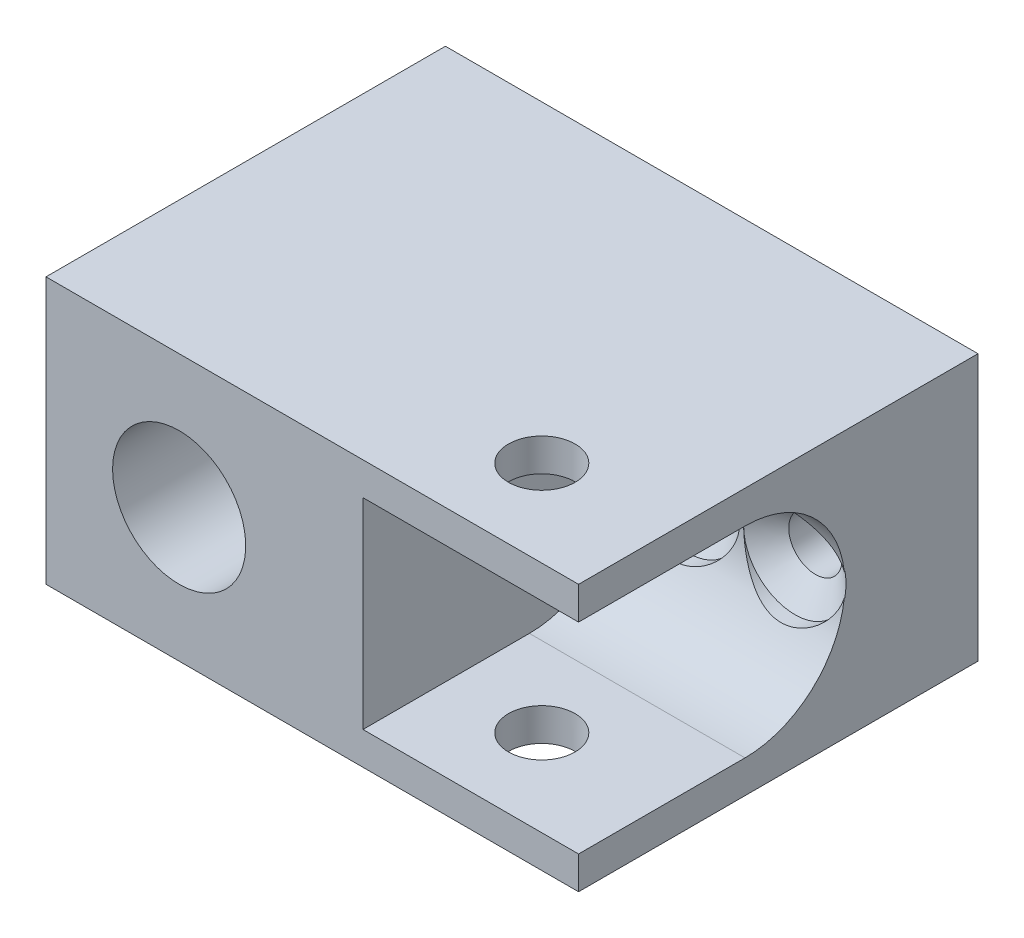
ISO-10303-21;
HEADER;
FILE_DESCRIPTION(('STEP AP214'),'2;1');
FILE_NAME('part.step','',(''),(''),'','','');
FILE_SCHEMA(('AUTOMOTIVE_DESIGN { 1 0 10303 214 1 1 1 1 }'));
ENDSEC;
DATA;
#1=APPLICATION_CONTEXT('core data for automotive mechanical design processes');
#2=APPLICATION_PROTOCOL_DEFINITION('international standard','automotive_design',2000,#1);
#3=PRODUCT_CONTEXT('',#1,'mechanical');
#4=PRODUCT('Part','Part','',(#3));
#5=PRODUCT_RELATED_PRODUCT_CATEGORY('part','',(#4));
#6=PRODUCT_DEFINITION_FORMATION('','',#4);
#7=PRODUCT_DEFINITION_CONTEXT('part definition',#1,'design');
#8=PRODUCT_DEFINITION('design','',#6,#7);
#9=PRODUCT_DEFINITION_SHAPE('','',#8);
#10=(LENGTH_UNIT() NAMED_UNIT(*) SI_UNIT(.MILLI.,.METRE.));
#11=(NAMED_UNIT(*) PLANE_ANGLE_UNIT() SI_UNIT($,.RADIAN.));
#12=(NAMED_UNIT(*) SI_UNIT($,.STERADIAN.) SOLID_ANGLE_UNIT());
#13=UNCERTAINTY_MEASURE_WITH_UNIT(LENGTH_MEASURE(1.E-05),#10,'distance_accuracy_value','');
#14=(GEOMETRIC_REPRESENTATION_CONTEXT(3) GLOBAL_UNCERTAINTY_ASSIGNED_CONTEXT((#13)) GLOBAL_UNIT_ASSIGNED_CONTEXT((#10,
#11,#12)) REPRESENTATION_CONTEXT('',''));
#15=CARTESIAN_POINT('',(0.,0.,0.));
#16=DIRECTION('',(0.,0.,1.));
#17=DIRECTION('',(1.,0.,0.));
#18=AXIS2_PLACEMENT_3D('',#15,#16,#17);
#19=CARTESIAN_POINT('',(0.,0.,12.7));
#20=DIRECTION('',(0.,0.,1.));
#21=DIRECTION('',(1.,0.,0.));
#22=AXIS2_PLACEMENT_3D('',#19,#20,#21);
#23=PLANE('',#22);
#24=CARTESIAN_POINT('',(35.8774999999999,0.,12.7));
#25=DIRECTION('',(0.,0.,1.));
#26=DIRECTION('',(1.,0.,0.));
#27=AXIS2_PLACEMENT_3D('',#24,#25,#26);
#28=CIRCLE('',#27,4.8895);
#29=CARTESIAN_POINT('',(30.9882639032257,0.0508000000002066,12.7));
#30=VERTEX_POINT('',#29);
#31=CARTESIAN_POINT('',(30.9882639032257,-0.0508000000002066,12.7));
#32=VERTEX_POINT('',#31);
#33=EDGE_CURVE('E148',#30,#32,#28,.T.);
#34=ORIENTED_EDGE('',*,*,#33,.F.);
#35=DIRECTION('',(-1.,0.,0.));
#36=VECTOR('',#35,1.);
#37=CARTESIAN_POINT('',(0.,0.0508000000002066,12.7));
#38=LINE('',#37,#36);
#39=CARTESIAN_POINT('',(30.2350825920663,0.0508000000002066,12.7));
#40=VERTEX_POINT('',#39);
#41=EDGE_CURVE('E158',#30,#40,#38,.T.);
#42=ORIENTED_EDGE('',*,*,#41,.T.);
#43=DIRECTION('',(0.,-1.,0.));
#44=VECTOR('',#43,1.);
#45=CARTESIAN_POINT('',(30.2350825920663,-9.57580000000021,12.7));
#46=LINE('',#45,#44);
#47=CARTESIAN_POINT('',(30.2350825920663,-0.0508000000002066,12.7));
#48=VERTEX_POINT('',#47);
#49=EDGE_CURVE('E215',#40,#48,#46,.T.);
#50=ORIENTED_EDGE('',*,*,#49,.T.);
#51=DIRECTION('',(1.,0.,0.));
#52=VECTOR('',#51,1.);
#53=CARTESIAN_POINT('',(0.,-0.0508000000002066,12.7));
#54=LINE('',#53,#52);
#55=EDGE_CURVE('E174',#48,#32,#54,.T.);
#56=ORIENTED_EDGE('',*,*,#55,.T.);
#57=EDGE_LOOP('',(#34,#42,#50,#56));
#58=FACE_BOUND('',#57,.T.);
#59=ADVANCED_FACE('F37',(#58),#23,.T.);
#60=CARTESIAN_POINT('',(0.,0.,38.1));
#61=DIRECTION('',(0.,0.,1.));
#62=DIRECTION('',(1.,0.,0.));
#63=AXIS2_PLACEMENT_3D('',#60,#61,#62);
#64=PLANE('',#63);
#65=DIRECTION('',(-1.,0.,0.));
#66=VECTOR('',#65,1.);
#67=CARTESIAN_POINT('',(71.3649174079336,9.57580000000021,38.1));
#68=LINE('',#67,#66);
#69=CARTESIAN_POINT('',(50.7999999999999,9.57580000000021,38.1));
#70=VERTEX_POINT('',#69);
#71=CARTESIAN_POINT('',(30.2350825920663,9.57580000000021,38.1));
#72=VERTEX_POINT('',#71);
#73=EDGE_CURVE('E219',#70,#72,#68,.T.);
#74=ORIENTED_EDGE('',*,*,#73,.F.);
#75=DIRECTION('',(0.,1.,0.));
#76=VECTOR('',#75,1.);
#77=CARTESIAN_POINT('',(50.7999999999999,-12.7,38.1));
#78=LINE('',#77,#76);
#79=CARTESIAN_POINT('',(50.7999999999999,12.7,38.1));
#80=VERTEX_POINT('',#79);
#81=EDGE_CURVE('E246',#70,#80,#78,.T.);
#82=ORIENTED_EDGE('',*,*,#81,.T.);
#83=DIRECTION('',(-1.,0.,0.));
#84=VECTOR('',#83,1.);
#85=CARTESIAN_POINT('',(50.7999999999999,12.7,38.1));
#86=LINE('',#85,#84);
#87=CARTESIAN_POINT('',(0.,12.7,38.1));
#88=VERTEX_POINT('',#87);
#89=EDGE_CURVE('E249',#80,#88,#86,.T.);
#90=ORIENTED_EDGE('',*,*,#89,.T.);
#91=DIRECTION('',(0.,-1.,0.));
#92=VECTOR('',#91,1.);
#93=CARTESIAN_POINT('',(0.,-12.7,38.1));
#94=LINE('',#93,#92);
#95=CARTESIAN_POINT('',(0.,-12.7,38.1));
#96=VERTEX_POINT('',#95);
#97=EDGE_CURVE('E240',#88,#96,#94,.T.);
#98=ORIENTED_EDGE('',*,*,#97,.T.);
#99=DIRECTION('',(1.,0.,0.));
#100=VECTOR('',#99,1.);
#101=CARTESIAN_POINT('',(50.7999999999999,-12.7,38.1));
#102=LINE('',#101,#100);
#103=CARTESIAN_POINT('',(50.7999999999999,-12.7,38.1));
#104=VERTEX_POINT('',#103);
#105=EDGE_CURVE('E243',#96,#104,#102,.T.);
#106=ORIENTED_EDGE('',*,*,#105,.T.);
#107=CARTESIAN_POINT('',(50.7999999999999,-9.57580000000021,38.1));
#108=VERTEX_POINT('',#107);
#109=EDGE_CURVE('E247',#104,#108,#78,.T.);
#110=ORIENTED_EDGE('',*,*,#109,.T.);
#111=DIRECTION('',(1.,0.,0.));
#112=VECTOR('',#111,1.);
#113=CARTESIAN_POINT('',(71.3649174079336,-9.57580000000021,38.1));
#114=LINE('',#113,#112);
#115=CARTESIAN_POINT('',(30.2350825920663,-9.57580000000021,38.1));
#116=VERTEX_POINT('',#115);
#117=EDGE_CURVE('E203',#116,#108,#114,.T.);
#118=ORIENTED_EDGE('',*,*,#117,.F.);
#119=DIRECTION('',(0.,-1.,0.));
#120=VECTOR('',#119,1.);
#121=CARTESIAN_POINT('',(30.2350825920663,-9.57580000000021,38.1));
#122=LINE('',#121,#120);
#123=EDGE_CURVE('E229',#72,#116,#122,.T.);
#124=ORIENTED_EDGE('',*,*,#123,.F.);
#125=EDGE_LOOP('',(#74,#82,#90,#98,#106,#110,#118,#124));
#126=FACE_BOUND('',#125,.T.);
#127=CARTESIAN_POINT('',(12.6999999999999,0.,38.1));
#128=DIRECTION('',(0.,0.,1.));
#129=DIRECTION('',(1.,0.,0.));
#130=AXIS2_PLACEMENT_3D('',#127,#128,#129);
#131=CIRCLE('',#130,6.35);
#132=CARTESIAN_POINT('',(6.34999999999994,0.,38.1));
#133=VERTEX_POINT('',#132);
#134=EDGE_CURVE('E234',#133,#133,#131,.T.);
#135=ORIENTED_EDGE('',*,*,#134,.F.);
#136=EDGE_LOOP('',(#135));
#137=FACE_BOUND('',#136,.T.);
#138=ADVANCED_FACE('F362',(#126,#137),#64,.T.);
#139=CARTESIAN_POINT('',(0.,0.,0.));
#140=DIRECTION('',(0.,0.,1.));
#141=DIRECTION('',(1.,0.,0.));
#142=AXIS2_PLACEMENT_3D('',#139,#140,#141);
#143=PLANE('',#142);
#144=CARTESIAN_POINT('',(35.8774999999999,0.,0.));
#145=DIRECTION('',(0.,0.,1.));
#146=DIRECTION('',(1.,0.,0.));
#147=AXIS2_PLACEMENT_3D('',#144,#145,#146);
#148=CIRCLE('',#147,2.5527);
#149=CARTESIAN_POINT('',(38.4301999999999,0.,0.));
#150=VERTEX_POINT('',#149);
#151=EDGE_CURVE('E514',#150,#150,#148,.T.);
#152=ORIENTED_EDGE('',*,*,#151,.T.);
#153=EDGE_LOOP('',(#152));
#154=FACE_BOUND('',#153,.T.);
#155=CARTESIAN_POINT('',(46.0374999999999,0.,0.));
#156=DIRECTION('',(0.,0.,1.));
#157=DIRECTION('',(1.,0.,0.));
#158=AXIS2_PLACEMENT_3D('',#155,#156,#157);
#159=CIRCLE('',#158,2.5527);
#160=CARTESIAN_POINT('',(48.5901999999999,0.,0.));
#161=VERTEX_POINT('',#160);
#162=EDGE_CURVE('E330',#161,#161,#159,.T.);
#163=ORIENTED_EDGE('',*,*,#162,.T.);
#164=EDGE_LOOP('',(#163));
#165=FACE_BOUND('',#164,.T.);
#166=DIRECTION('',(0.,-1.,0.));
#167=VECTOR('',#166,1.);
#168=CARTESIAN_POINT('',(0.,-12.7,0.));
#169=LINE('',#168,#167);
#170=CARTESIAN_POINT('',(0.,12.7,0.));
#171=VERTEX_POINT('',#170);
#172=CARTESIAN_POINT('',(0.,-12.7,0.));
#173=VERTEX_POINT('',#172);
#174=EDGE_CURVE('E237',#171,#173,#169,.T.);
#175=ORIENTED_EDGE('',*,*,#174,.F.);
#176=DIRECTION('',(-1.,0.,0.));
#177=VECTOR('',#176,1.);
#178=CARTESIAN_POINT('',(50.7999999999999,12.7,0.));
#179=LINE('',#178,#177);
#180=CARTESIAN_POINT('',(50.7999999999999,12.7,0.));
#181=VERTEX_POINT('',#180);
#182=EDGE_CURVE('E244',#181,#171,#179,.T.);
#183=ORIENTED_EDGE('',*,*,#182,.F.);
#184=DIRECTION('',(0.,1.,0.));
#185=VECTOR('',#184,1.);
#186=CARTESIAN_POINT('',(50.7999999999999,-12.7,0.));
#187=LINE('',#186,#185);
#188=CARTESIAN_POINT('',(50.7999999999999,-12.7,0.));
#189=VERTEX_POINT('',#188);
#190=EDGE_CURVE('E256',#189,#181,#187,.T.);
#191=ORIENTED_EDGE('',*,*,#190,.F.);
#192=DIRECTION('',(1.,0.,0.));
#193=VECTOR('',#192,1.);
#194=CARTESIAN_POINT('',(50.7999999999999,-12.7,0.));
#195=LINE('',#194,#193);
#196=EDGE_CURVE('E254',#173,#189,#195,.T.);
#197=ORIENTED_EDGE('',*,*,#196,.F.);
#198=EDGE_LOOP('',(#175,#183,#191,#197));
#199=FACE_BOUND('',#198,.T.);
#200=CARTESIAN_POINT('',(12.6999999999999,0.,0.));
#201=DIRECTION('',(0.,0.,1.));
#202=DIRECTION('',(1.,0.,0.));
#203=AXIS2_PLACEMENT_3D('',#200,#201,#202);
#204=CIRCLE('',#203,6.35);
#205=CARTESIAN_POINT('',(6.34999999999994,0.,0.));
#206=VERTEX_POINT('',#205);
#207=EDGE_CURVE('E232',#206,#206,#204,.T.);
#208=ORIENTED_EDGE('',*,*,#207,.T.);
#209=EDGE_LOOP('',(#208));
#210=FACE_BOUND('',#209,.T.);
#211=ADVANCED_FACE('F311',(#154,#165,#199,#210),#143,.F.);
#212=CARTESIAN_POINT('',(0.,-12.7,38.1));
#213=DIRECTION('',(1.,0.,0.));
#214=DIRECTION('',(0.,1.,0.));
#215=AXIS2_PLACEMENT_3D('',#212,#213,#214);
#216=PLANE('',#215);
#217=ORIENTED_EDGE('',*,*,#174,.T.);
#218=DIRECTION('',(0.,0.,-1.));
#219=VECTOR('',#218,1.);
#220=CARTESIAN_POINT('',(0.,-12.7,38.1));
#221=LINE('',#220,#219);
#222=EDGE_CURVE('E205',#96,#173,#221,.T.);
#223=ORIENTED_EDGE('',*,*,#222,.F.);
#224=ORIENTED_EDGE('',*,*,#97,.F.);
#225=DIRECTION('',(0.,0.,-1.));
#226=VECTOR('',#225,1.);
#227=CARTESIAN_POINT('',(0.,12.7,38.1));
#228=LINE('',#227,#226);
#229=EDGE_CURVE('E251',#88,#171,#228,.T.);
#230=ORIENTED_EDGE('',*,*,#229,.T.);
#231=EDGE_LOOP('',(#217,#223,#224,#230));
#232=FACE_BOUND('',#231,.T.);
#233=ADVANCED_FACE('F306',(#232),#216,.F.);
#234=CARTESIAN_POINT('',(50.7999999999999,-12.7,38.1));
#235=DIRECTION('',(0.,1.,0.));
#236=DIRECTION('',(-1.,0.,0.));
#237=AXIS2_PLACEMENT_3D('',#234,#235,#236);
#238=PLANE('',#237);
#239=CARTESIAN_POINT('',(39.0361825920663,-12.7,29.8449999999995));
#240=DIRECTION('',(0.,1.,0.));
#241=DIRECTION('',(-1.,0.,0.));
#242=AXIS2_PLACEMENT_3D('',#239,#240,#241);
#243=CIRCLE('',#242,3.175);
#244=CARTESIAN_POINT('',(35.8611825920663,-12.7,29.8449999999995));
#245=VERTEX_POINT('',#244);
#246=EDGE_CURVE('E332',#245,#245,#243,.T.);
#247=ORIENTED_EDGE('',*,*,#246,.T.);
#248=EDGE_LOOP('',(#247));
#249=FACE_BOUND('',#248,.T.);
#250=ORIENTED_EDGE('',*,*,#196,.T.);
#251=DIRECTION('',(0.,0.,-1.));
#252=VECTOR('',#251,1.);
#253=CARTESIAN_POINT('',(50.7999999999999,-12.7,38.1));
#254=LINE('',#253,#252);
#255=EDGE_CURVE('E264',#104,#189,#254,.T.);
#256=ORIENTED_EDGE('',*,*,#255,.F.);
#257=ORIENTED_EDGE('',*,*,#105,.F.);
#258=ORIENTED_EDGE('',*,*,#222,.T.);
#259=EDGE_LOOP('',(#250,#256,#257,#258));
#260=FACE_BOUND('',#259,.T.);
#261=ADVANCED_FACE('F310',(#249,#260),#238,.F.);
#262=CARTESIAN_POINT('',(50.7999999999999,-12.7,38.1));
#263=DIRECTION('',(-1.,0.,0.));
#264=DIRECTION('',(0.,0.,1.));
#265=AXIS2_PLACEMENT_3D('',#262,#263,#264);
#266=PLANE('',#265);
#267=CARTESIAN_POINT('',(50.7999999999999,0.0508000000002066,22.225));
#268=DIRECTION('',(-1.,0.,0.));
#269=DIRECTION('',(0.,0.,1.));
#270=AXIS2_PLACEMENT_3D('',#267,#268,#269);
#271=CIRCLE('',#270,9.525);
#272=CARTESIAN_POINT('',(50.7999999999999,9.57580000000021,22.225));
#273=VERTEX_POINT('',#272);
#274=CARTESIAN_POINT('',(50.7999999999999,1.10716033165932,12.7587585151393));
#275=VERTEX_POINT('',#274);
#276=EDGE_CURVE('E11',#273,#275,#271,.T.);
#277=ORIENTED_EDGE('',*,*,#276,.T.);
#278=DIRECTION('',(0.,0.,-1.));
#279=VECTOR('',#278,1.);
#280=CARTESIAN_POINT('',(50.7999999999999,1.10716033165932,22.7));
#281=LINE('',#280,#279);
#282=CARTESIAN_POINT('',(50.7999999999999,1.10716033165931,12.7));
#283=VERTEX_POINT('',#282);
#284=EDGE_CURVE('E276',#275,#283,#281,.T.);
#285=ORIENTED_EDGE('',*,*,#284,.T.);
#286=CARTESIAN_POINT('',(50.7999999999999,-9.21463313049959,17.3008687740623));
#287=CARTESIAN_POINT('',(50.7999999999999,-9.01275327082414,17.1504011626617));
#288=CARTESIAN_POINT('',(50.7999999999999,-8.8103885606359,17.0005787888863));
#289=CARTESIAN_POINT('',(50.7999999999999,-8.40446368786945,16.7025356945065));
#290=CARTESIAN_POINT('',(50.7999999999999,-8.20090344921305,16.5543150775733));
#291=CARTESIAN_POINT('',(50.7999999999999,-7.79191046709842,16.2594620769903));
#292=CARTESIAN_POINT('',(50.7999999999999,-7.58647445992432,16.1128342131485));
#293=CARTESIAN_POINT('',(50.7999999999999,-7.17392377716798,15.8219660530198));
#294=CARTESIAN_POINT('',(50.7999999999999,-6.96680914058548,15.6777257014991));
#295=CARTESIAN_POINT('',(50.7999999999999,-6.5406005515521,15.3853811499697));
#296=CARTESIAN_POINT('',(50.7999999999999,-6.32140708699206,15.2374216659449));
#297=CARTESIAN_POINT('',(50.7999999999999,-5.88028150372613,14.9456464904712));
#298=CARTESIAN_POINT('',(50.7999999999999,-5.65834948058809,14.8018306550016));
#299=CARTESIAN_POINT('',(50.7999999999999,-5.21128541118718,14.519696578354));
#300=CARTESIAN_POINT('',(50.7999999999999,-4.98615645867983,14.3813734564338));
#301=CARTESIAN_POINT('',(50.7999999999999,-4.53170379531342,14.111830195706));
#302=CARTESIAN_POINT('',(50.7999999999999,-4.30238071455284,13.9806090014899));
#303=CARTESIAN_POINT('',(50.7999999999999,-3.84044928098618,13.7287720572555));
#304=CARTESIAN_POINT('',(50.7999999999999,-3.60788503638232,13.6080760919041));
#305=CARTESIAN_POINT('',(50.7999999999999,-3.13633977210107,13.37942679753));
#306=CARTESIAN_POINT('',(50.7999999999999,-2.89735557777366,13.2714799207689));
#307=CARTESIAN_POINT('',(50.7999999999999,-2.41487095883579,13.0743597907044));
#308=CARTESIAN_POINT('',(50.7999999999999,-2.17145448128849,12.9849842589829));
#309=CARTESIAN_POINT('',(50.7999999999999,-1.67734862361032,12.8297098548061));
#310=CARTESIAN_POINT('',(50.7999999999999,-1.42667071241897,12.7637759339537));
#311=CARTESIAN_POINT('',(50.7999999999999,-1.06441988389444,12.6910683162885));
#312=CARTESIAN_POINT('',(50.7999999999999,-0.95526154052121,12.6720236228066));
#313=CARTESIAN_POINT('',(50.7999999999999,-0.735953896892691,12.6398517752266));
#314=CARTESIAN_POINT('',(50.7999999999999,-0.625803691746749,12.6267307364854));
#315=CARTESIAN_POINT('',(50.7999999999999,-0.353441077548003,12.6021514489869));
#316=CARTESIAN_POINT('',(50.7999999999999,-0.190884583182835,12.5943165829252));
#317=CARTESIAN_POINT('',(50.7999999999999,0.134342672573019,12.5926929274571));
#318=CARTESIAN_POINT('',(50.7999999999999,0.297013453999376,12.5989088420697));
#319=CARTESIAN_POINT('',(50.7999999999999,0.621477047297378,12.6250331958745));
#320=CARTESIAN_POINT('',(50.7999999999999,0.783268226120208,12.6449616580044));
#321=CARTESIAN_POINT('',(50.7999999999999,1.10476769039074,12.6974085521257));
#322=CARTESIAN_POINT('',(50.7999999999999,1.26447580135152,12.7299280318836));
#323=CARTESIAN_POINT('',(50.7999999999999,1.68084652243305,12.8299423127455));
#324=CARTESIAN_POINT('',(50.7999999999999,1.93531353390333,12.9065709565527));
#325=CARTESIAN_POINT('',(50.7999999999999,2.43650462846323,13.0819588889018));
#326=CARTESIAN_POINT('',(50.7999999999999,2.68322139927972,13.18073840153));
#327=CARTESIAN_POINT('',(50.7999999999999,3.04940153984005,13.3416112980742));
#328=CARTESIAN_POINT('',(50.7999999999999,3.1715490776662,13.3977369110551));
#329=CARTESIAN_POINT('',(50.7999999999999,3.41416715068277,13.5135135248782));
#330=CARTESIAN_POINT('',(50.7999999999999,3.5346376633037,13.5731645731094));
#331=CARTESIAN_POINT('',(50.7999999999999,3.7739909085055,13.6954278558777));
#332=CARTESIAN_POINT('',(50.7999999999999,3.89287433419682,13.7580387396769));
#333=CARTESIAN_POINT('',(50.7999999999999,4.12925113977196,13.8858118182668));
#334=CARTESIAN_POINT('',(50.7999999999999,4.24674458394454,13.9509738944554));
#335=CARTESIAN_POINT('',(50.7999999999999,4.65615325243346,14.1830324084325));
#336=CARTESIAN_POINT('',(50.7999999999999,4.94483048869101,14.355646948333));
#337=CARTESIAN_POINT('',(50.7999999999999,5.51637473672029,14.7102766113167));
#338=CARTESIAN_POINT('',(50.7999999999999,5.79924028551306,14.8922940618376));
#339=CARTESIAN_POINT('',(50.7999999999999,6.36073677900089,15.2632027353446));
#340=CARTESIAN_POINT('',(50.7999999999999,6.63936417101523,15.4520993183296));
#341=CARTESIAN_POINT('',(50.7999999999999,7.19315435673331,15.8348280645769));
#342=CARTESIAN_POINT('',(50.7999999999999,7.46831747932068,16.0286597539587));
#343=CARTESIAN_POINT('',(50.7999999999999,8.01682535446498,16.4206825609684));
#344=CARTESIAN_POINT('',(50.7999999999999,8.29016164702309,16.6188854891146));
#345=CARTESIAN_POINT('',(50.7999999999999,8.83470482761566,17.0182014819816));
#346=CARTESIAN_POINT('',(50.7999999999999,9.1059116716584,17.2193146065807));
#347=CARTESIAN_POINT('',(50.7999999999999,9.64648916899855,17.6237345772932));
#348=CARTESIAN_POINT('',(50.7999999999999,9.91586060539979,17.8270403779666));
#349=CARTESIAN_POINT('',(50.7999999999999,10.4532120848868,18.2354835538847));
#350=CARTESIAN_POINT('',(50.7999999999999,10.7211921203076,18.4406209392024));
#351=CARTESIAN_POINT('',(50.7999999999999,11.46129214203,19.0104158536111));
#352=CARTESIAN_POINT('',(50.7999999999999,11.9322026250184,19.3766439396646));
#353=CARTESIAN_POINT('',(50.7999999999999,12.8715050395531,20.1124354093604));
#354=CARTESIAN_POINT('',(50.7999999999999,13.3398966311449,20.4819992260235));
#355=CARTESIAN_POINT('',(50.7999999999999,14.2719695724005,21.2213489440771));
#356=CARTESIAN_POINT('',(50.7999999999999,14.7356623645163,21.5911204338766));
#357=CARTESIAN_POINT('',(50.7999999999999,15.6614884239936,22.3324660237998));
#358=CARTESIAN_POINT('',(50.7999999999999,16.1236219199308,22.7040398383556));
#359=CARTESIAN_POINT('',(50.7999999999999,16.5852198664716,23.076273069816));
#360=B_SPLINE_CURVE_WITH_KNOTS('',3,(#286,#287,#288,#289,#290,#291,#292,#293,#294,#295,#296,
#297,#298,#299,#300,#301,#302,#303,#304,#305,#306,#307,#308,#309,#310,#311,#312,#313,#314,#315,
#316,#317,#318,#319,#320,#321,#322,#323,#324,#325,#326,#327,#328,#329,#330,#331,#332,#333,#334,
#335,#336,#337,#338,#339,#340,#341,#342,#343,#344,#345,#346,#347,#348,#349,#350,#351,#352,#353,
#354,#355,#356,#357,#358,#359),.UNSPECIFIED.,.F.,.F.,(4,2,2,2,2,2,2,2,2,2,2,2,2,2,2,2,2,2,2,2,2,
2,2,2,2,2,2,2,2,2,2,2,2,2,2,2,4),(0.,0.755360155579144,1.51076891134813,2.2679425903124,
3.02509872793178,3.81843485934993,4.61174338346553,5.40433044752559,6.19679940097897,
6.98257493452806,7.76874645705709,8.54584525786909,9.32177725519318,9.65406103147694,
9.98668706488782,10.4742979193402,10.9620720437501,11.4505599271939,11.9390884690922,
12.7348681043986,13.5313772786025,13.9346076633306,14.337843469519,14.7408970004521,
15.1439318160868,16.1526719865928,17.1616630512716,18.1714578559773,19.1811560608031,
20.1940353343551,21.2069354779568,22.2193723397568,23.2318147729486,25.0214611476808,
26.8113432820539,28.5905730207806,30.369529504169),.UNSPECIFIED.);
#361=CARTESIAN_POINT('',(50.7999999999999,-1.10716033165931,12.7));
#362=VERTEX_POINT('',#361);
#363=EDGE_CURVE('E322',#283,#362,#360,.F.);
#364=ORIENTED_EDGE('',*,*,#363,.T.);
#365=DIRECTION('',(0.,0.,-1.));
#366=VECTOR('',#365,1.);
#367=CARTESIAN_POINT('',(50.7999999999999,-1.10716033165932,22.7));
#368=LINE('',#367,#366);
#369=CARTESIAN_POINT('',(50.7999999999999,-1.10716033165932,12.7587585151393));
#370=VERTEX_POINT('',#369);
#371=EDGE_CURVE('E53',#362,#370,#368,.F.);
#372=ORIENTED_EDGE('',*,*,#371,.T.);
#373=CARTESIAN_POINT('',(50.7999999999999,-0.0508000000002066,22.225));
#374=DIRECTION('',(-1.,0.,0.));
#375=DIRECTION('',(0.,0.,1.));
#376=AXIS2_PLACEMENT_3D('',#373,#374,#375);
#377=CIRCLE('',#376,9.525);
#378=CARTESIAN_POINT('',(50.7999999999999,-9.57580000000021,22.225));
#379=VERTEX_POINT('',#378);
#380=EDGE_CURVE('E46',#370,#379,#377,.T.);
#381=ORIENTED_EDGE('',*,*,#380,.T.);
#382=DIRECTION('',(0.,0.,1.));
#383=VECTOR('',#382,1.);
#384=CARTESIAN_POINT('',(50.7999999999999,-9.57580000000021,38.1));
#385=LINE('',#384,#383);
#386=EDGE_CURVE('E193',#379,#108,#385,.T.);
#387=ORIENTED_EDGE('',*,*,#386,.T.);
#388=ORIENTED_EDGE('',*,*,#109,.F.);
#389=ORIENTED_EDGE('',*,*,#255,.T.);
#390=ORIENTED_EDGE('',*,*,#190,.T.);
#391=DIRECTION('',(0.,0.,-1.));
#392=VECTOR('',#391,1.);
#393=CARTESIAN_POINT('',(50.7999999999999,12.7,38.1));
#394=LINE('',#393,#392);
#395=EDGE_CURVE('E261',#80,#181,#394,.T.);
#396=ORIENTED_EDGE('',*,*,#395,.F.);
#397=ORIENTED_EDGE('',*,*,#81,.F.);
#398=DIRECTION('',(0.,0.,-1.));
#399=VECTOR('',#398,1.);
#400=CARTESIAN_POINT('',(50.7999999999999,9.57580000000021,38.1));
#401=LINE('',#400,#399);
#402=EDGE_CURVE('E176',#70,#273,#401,.T.);
#403=ORIENTED_EDGE('',*,*,#402,.T.);
#404=EDGE_LOOP('',(#277,#285,#364,#372,#381,#387,#388,#389,#390,#396,#397,#403));
#405=FACE_BOUND('',#404,.T.);
#406=ADVANCED_FACE('F191',(#405),#266,.F.);
#407=CARTESIAN_POINT('',(50.7999999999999,12.7,38.1));
#408=DIRECTION('',(0.,-1.,0.));
#409=DIRECTION('',(1.,0.,0.));
#410=AXIS2_PLACEMENT_3D('',#407,#408,#409);
#411=PLANE('',#410);
#412=CARTESIAN_POINT('',(39.0361825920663,12.7,29.8449999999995));
#413=DIRECTION('',(0.,1.,0.));
#414=DIRECTION('',(-1.,0.,0.));
#415=AXIS2_PLACEMENT_3D('',#412,#413,#414);
#416=CIRCLE('',#415,3.175);
#417=CARTESIAN_POINT('',(35.8611825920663,12.7,29.8449999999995));
#418=VERTEX_POINT('',#417);
#419=EDGE_CURVE('E329',#418,#418,#416,.T.);
#420=ORIENTED_EDGE('',*,*,#419,.F.);
#421=EDGE_LOOP('',(#420));
#422=FACE_BOUND('',#421,.T.);
#423=ORIENTED_EDGE('',*,*,#182,.T.);
#424=ORIENTED_EDGE('',*,*,#229,.F.);
#425=ORIENTED_EDGE('',*,*,#89,.F.);
#426=ORIENTED_EDGE('',*,*,#395,.T.);
#427=EDGE_LOOP('',(#423,#424,#425,#426));
#428=FACE_BOUND('',#427,.T.);
#429=ADVANCED_FACE('F319',(#422,#428),#411,.F.);
#430=CARTESIAN_POINT('',(12.6999999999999,0.,38.1));
#431=DIRECTION('',(0.,0.,-1.));
#432=DIRECTION('',(-1.,0.,0.));
#433=AXIS2_PLACEMENT_3D('',#430,#431,#432);
#434=CYLINDRICAL_SURFACE('',#433,6.35);
#435=CARTESIAN_POINT('',(6.34999999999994,0.,38.1));
#436=CARTESIAN_POINT('',(6.34999999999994,0.,37.703125));
#437=CARTESIAN_POINT('',(6.34999999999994,0.,37.30625));
#438=CARTESIAN_POINT('',(6.34999999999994,0.,36.5125));
#439=CARTESIAN_POINT('',(6.34999999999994,0.,36.115625));
#440=CARTESIAN_POINT('',(6.34999999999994,0.,35.321875));
#441=CARTESIAN_POINT('',(6.34999999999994,0.,34.925));
#442=CARTESIAN_POINT('',(6.34999999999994,0.,34.13125));
#443=CARTESIAN_POINT('',(6.34999999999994,0.,33.734375));
#444=CARTESIAN_POINT('',(6.34999999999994,0.,32.940625));
#445=CARTESIAN_POINT('',(6.34999999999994,0.,32.54375));
#446=CARTESIAN_POINT('',(6.34999999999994,0.,31.75));
#447=CARTESIAN_POINT('',(6.34999999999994,0.,31.353125));
#448=CARTESIAN_POINT('',(6.34999999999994,0.,30.559375));
#449=CARTESIAN_POINT('',(6.34999999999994,0.,30.1625));
#450=CARTESIAN_POINT('',(6.34999999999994,0.,29.36875));
#451=CARTESIAN_POINT('',(6.34999999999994,0.,28.971875));
#452=CARTESIAN_POINT('',(6.34999999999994,0.,28.178125));
#453=CARTESIAN_POINT('',(6.34999999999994,0.,27.78125));
#454=CARTESIAN_POINT('',(6.34999999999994,0.,26.9875));
#455=CARTESIAN_POINT('',(6.34999999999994,0.,26.590625));
#456=CARTESIAN_POINT('',(6.34999999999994,0.,25.796875));
#457=CARTESIAN_POINT('',(6.34999999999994,0.,25.4));
#458=CARTESIAN_POINT('',(6.34999999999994,0.,24.60625));
#459=CARTESIAN_POINT('',(6.34999999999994,0.,24.209375));
#460=CARTESIAN_POINT('',(6.34999999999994,0.,23.415625));
#461=CARTESIAN_POINT('',(6.34999999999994,0.,23.01875));
#462=CARTESIAN_POINT('',(6.34999999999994,0.,22.225));
#463=CARTESIAN_POINT('',(6.34999999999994,0.,21.828125));
#464=CARTESIAN_POINT('',(6.34999999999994,0.,21.034375));
#465=CARTESIAN_POINT('',(6.34999999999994,0.,20.6375));
#466=CARTESIAN_POINT('',(6.34999999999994,0.,19.84375));
#467=CARTESIAN_POINT('',(6.34999999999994,0.,19.446875));
#468=CARTESIAN_POINT('',(6.34999999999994,0.,18.653125));
#469=CARTESIAN_POINT('',(6.34999999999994,0.,18.25625));
#470=CARTESIAN_POINT('',(6.34999999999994,0.,17.4625));
#471=CARTESIAN_POINT('',(6.34999999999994,0.,17.065625));
#472=CARTESIAN_POINT('',(6.34999999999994,0.,16.271875));
#473=CARTESIAN_POINT('',(6.34999999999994,0.,15.875));
#474=CARTESIAN_POINT('',(6.34999999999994,0.,15.08125));
#475=CARTESIAN_POINT('',(6.34999999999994,0.,14.684375));
#476=CARTESIAN_POINT('',(6.34999999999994,0.,13.890625));
#477=CARTESIAN_POINT('',(6.34999999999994,0.,13.49375));
#478=CARTESIAN_POINT('',(6.34999999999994,0.,12.7));
#479=CARTESIAN_POINT('',(6.34999999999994,0.,12.303125));
#480=CARTESIAN_POINT('',(6.34999999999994,0.,11.509375));
#481=CARTESIAN_POINT('',(6.34999999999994,0.,11.1125));
#482=CARTESIAN_POINT('',(6.34999999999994,0.,10.31875));
#483=CARTESIAN_POINT('',(6.34999999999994,0.,9.921875));
#484=CARTESIAN_POINT('',(6.34999999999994,0.,9.128125));
#485=CARTESIAN_POINT('',(6.34999999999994,0.,8.73125));
#486=CARTESIAN_POINT('',(6.34999999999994,0.,7.9375));
#487=CARTESIAN_POINT('',(6.34999999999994,0.,7.540625));
#488=CARTESIAN_POINT('',(6.34999999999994,0.,6.746875));
#489=CARTESIAN_POINT('',(6.34999999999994,0.,6.35));
#490=CARTESIAN_POINT('',(6.34999999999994,0.,5.55625));
#491=CARTESIAN_POINT('',(6.34999999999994,0.,5.159375));
#492=CARTESIAN_POINT('',(6.34999999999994,0.,4.365625));
#493=CARTESIAN_POINT('',(6.34999999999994,0.,3.96875));
#494=CARTESIAN_POINT('',(6.34999999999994,0.,3.175));
#495=CARTESIAN_POINT('',(6.34999999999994,0.,2.778125));
#496=CARTESIAN_POINT('',(6.34999999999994,0.,1.984375));
#497=CARTESIAN_POINT('',(6.34999999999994,0.,1.5875));
#498=CARTESIAN_POINT('',(6.34999999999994,0.,0.79375));
#499=CARTESIAN_POINT('',(6.34999999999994,0.,0.396875));
#500=CARTESIAN_POINT('',(6.34999999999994,0.,0.));
#501=B_SPLINE_CURVE_WITH_KNOTS('',3,(#435,#436,#437,#438,#439,#440,#441,#442,#443,#444,#445,
#446,#447,#448,#449,#450,#451,#452,#453,#454,#455,#456,#457,#458,#459,#460,#461,#462,#463,#464,
#465,#466,#467,#468,#469,#470,#471,#472,#473,#474,#475,#476,#477,#478,#479,#480,#481,#482,#483,
#484,#485,#486,#487,#488,#489,#490,#491,#492,#493,#494,#495,#496,#497,#498,#499,#500),
.UNSPECIFIED.,.F.,.F.,(4,2,2,2,2,2,2,2,2,2,2,2,2,2,2,2,2,2,2,2,2,2,2,2,2,2,2,2,2,2,2,2,4),(0.,
1.19062499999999,2.38124999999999,3.571875,4.7625,5.953125,7.14375,8.33437499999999,9.525,
10.715625,11.90625,13.096875,14.2875,15.478125,16.66875,17.859375,19.05,20.240625,21.43125,
22.621875,23.8125,25.003125,26.19375,27.384375,28.575,29.765625,30.95625,32.146875,33.3375,
34.528125,35.71875,36.909375,38.1),.UNSPECIFIED.);
#502=EDGE_CURVE('BSEAM352',#133,#206,#501,.T.);
#503=ORIENTED_EDGE('',*,*,#134,.T.);
#504=ORIENTED_EDGE('',*,*,#207,.F.);
#505=ORIENTED_EDGE('',*,*,#502,.T.);
#506=ORIENTED_EDGE('',*,*,#502,.F.);
#507=EDGE_LOOP('',(#503,#505,#504,#506));
#508=FACE_BOUND('',#507,.T.);
#509=ADVANCED_FACE('F352',(#508),#434,.F.);
#510=CARTESIAN_POINT('',(71.3649174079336,9.57580000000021,12.7));
#511=DIRECTION('',(0.,1.,0.));
#512=DIRECTION('',(0.,0.,1.));
#513=AXIS2_PLACEMENT_3D('',#510,#511,#512);
#514=PLANE('',#513);
#515=CARTESIAN_POINT('',(39.0361825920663,9.57580000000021,29.8449999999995));
#516=DIRECTION('',(0.,1.,0.));
#517=DIRECTION('',(0.,0.,1.));
#518=AXIS2_PLACEMENT_3D('',#515,#516,#517);
#519=CIRCLE('',#518,3.175);
#520=CARTESIAN_POINT('',(39.0361825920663,9.57580000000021,33.0199999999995));
#521=VERTEX_POINT('',#520);
#522=EDGE_CURVE('E227',#521,#521,#519,.T.);
#523=ORIENTED_EDGE('',*,*,#522,.T.);
#524=EDGE_LOOP('',(#523));
#525=FACE_BOUND('',#524,.T.);
#526=DIRECTION('',(0.,0.,1.));
#527=VECTOR('',#526,1.);
#528=CARTESIAN_POINT('',(30.2350825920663,9.57580000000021,12.7));
#529=LINE('',#528,#527);
#530=CARTESIAN_POINT('',(30.2350825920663,9.57580000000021,22.225));
#531=VERTEX_POINT('',#530);
#532=EDGE_CURVE('E221',#531,#72,#529,.T.);
#533=ORIENTED_EDGE('',*,*,#532,.F.);
#534=DIRECTION('',(-1.,0.,0.));
#535=VECTOR('',#534,1.);
#536=CARTESIAN_POINT('',(71.3649174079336,9.57580000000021,22.225));
#537=LINE('',#536,#535);
#538=EDGE_CURVE('E61',#531,#273,#537,.F.);
#539=ORIENTED_EDGE('',*,*,#538,.T.);
#540=ORIENTED_EDGE('',*,*,#402,.F.);
#541=ORIENTED_EDGE('',*,*,#73,.T.);
#542=EDGE_LOOP('',(#533,#539,#540,#541));
#543=FACE_BOUND('',#542,.T.);
#544=ADVANCED_FACE('F349',(#525,#543),#514,.F.);
#545=CARTESIAN_POINT('',(71.3649174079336,-9.57580000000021,12.7));
#546=DIRECTION('',(0.,-1.,0.));
#547=DIRECTION('',(0.,0.,-1.));
#548=AXIS2_PLACEMENT_3D('',#545,#546,#547);
#549=PLANE('',#548);
#550=CARTESIAN_POINT('',(39.0361825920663,-9.57580000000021,29.8449999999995));
#551=DIRECTION('',(0.,-1.,0.));
#552=DIRECTION('',(0.,0.,-1.));
#553=AXIS2_PLACEMENT_3D('',#550,#551,#552);
#554=CIRCLE('',#553,3.175);
#555=CARTESIAN_POINT('',(39.0361825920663,-9.57580000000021,26.6699999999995));
#556=VERTEX_POINT('',#555);
#557=EDGE_CURVE('E178',#556,#556,#554,.T.);
#558=ORIENTED_EDGE('',*,*,#557,.T.);
#559=EDGE_LOOP('',(#558));
#560=FACE_BOUND('',#559,.T.);
#561=ORIENTED_EDGE('',*,*,#386,.F.);
#562=DIRECTION('',(1.,0.,0.));
#563=VECTOR('',#562,1.);
#564=CARTESIAN_POINT('',(71.3649174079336,-9.57580000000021,22.225));
#565=LINE('',#564,#563);
#566=CARTESIAN_POINT('',(30.2350825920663,-9.57580000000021,22.225));
#567=VERTEX_POINT('',#566);
#568=EDGE_CURVE('E182',#379,#567,#565,.F.);
#569=ORIENTED_EDGE('',*,*,#568,.T.);
#570=DIRECTION('',(0.,0.,1.));
#571=VECTOR('',#570,1.);
#572=CARTESIAN_POINT('',(30.2350825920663,-9.57580000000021,12.7));
#573=LINE('',#572,#571);
#574=EDGE_CURVE('E217',#567,#116,#573,.T.);
#575=ORIENTED_EDGE('',*,*,#574,.T.);
#576=ORIENTED_EDGE('',*,*,#117,.T.);
#577=EDGE_LOOP('',(#561,#569,#575,#576));
#578=FACE_BOUND('',#577,.T.);
#579=ADVANCED_FACE('F200',(#560,#578),#549,.F.);
#580=CARTESIAN_POINT('',(40.7667360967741,-0.0508000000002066,12.7));
#581=VERTEX_POINT('',#580);
#582=CARTESIAN_POINT('',(40.7667360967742,0.0508000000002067,12.7));
#583=VERTEX_POINT('',#582);
#584=EDGE_CURVE('E150',#581,#583,#28,.T.);
#585=ORIENTED_EDGE('',*,*,#584,.F.);
#586=CARTESIAN_POINT('',(41.1482639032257,-0.0508000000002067,12.7));
#587=VERTEX_POINT('',#586);
#588=EDGE_CURVE('E172',#581,#587,#54,.T.);
#589=ORIENTED_EDGE('',*,*,#588,.T.);
#590=CARTESIAN_POINT('',(46.0374999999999,0.,12.7));
#591=DIRECTION('',(0.,0.,1.));
#592=DIRECTION('',(1.,0.,0.));
#593=AXIS2_PLACEMENT_3D('',#590,#591,#592);
#594=CIRCLE('',#593,4.8895);
#595=CARTESIAN_POINT('',(41.1482639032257,0.0508000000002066,12.7));
#596=VERTEX_POINT('',#595);
#597=EDGE_CURVE('E171',#596,#587,#594,.T.);
#598=ORIENTED_EDGE('',*,*,#597,.F.);
#599=EDGE_CURVE('E156',#596,#583,#38,.T.);
#600=ORIENTED_EDGE('',*,*,#599,.T.);
#601=EDGE_LOOP('',(#585,#589,#598,#600));
#602=FACE_BOUND('',#601,.T.);
#603=ADVANCED_FACE('F169',(#602),#23,.T.);
#604=CARTESIAN_POINT('',(30.2350825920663,-9.57580000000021,12.7));
#605=DIRECTION('',(-1.,0.,0.));
#606=DIRECTION('',(0.,0.,1.));
#607=AXIS2_PLACEMENT_3D('',#604,#605,#606);
#608=PLANE('',#607);
#609=ORIENTED_EDGE('',*,*,#574,.F.);
#610=CARTESIAN_POINT('',(30.2350825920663,-0.0508000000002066,22.225));
#611=DIRECTION('',(-1.,0.,0.));
#612=DIRECTION('',(0.,0.,1.));
#613=AXIS2_PLACEMENT_3D('',#610,#611,#612);
#614=CIRCLE('',#613,9.525);
#615=EDGE_CURVE('E186',#567,#48,#614,.F.);
#616=ORIENTED_EDGE('',*,*,#615,.T.);
#617=ORIENTED_EDGE('',*,*,#49,.F.);
#618=CARTESIAN_POINT('',(30.2350825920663,0.0508000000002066,22.225));
#619=DIRECTION('',(-1.,0.,0.));
#620=DIRECTION('',(0.,0.,1.));
#621=AXIS2_PLACEMENT_3D('',#618,#619,#620);
#622=CIRCLE('',#621,9.525);
#623=EDGE_CURVE('E184',#40,#531,#622,.F.);
#624=ORIENTED_EDGE('',*,*,#623,.T.);
#625=ORIENTED_EDGE('',*,*,#532,.T.);
#626=ORIENTED_EDGE('',*,*,#123,.T.);
#627=EDGE_LOOP('',(#609,#616,#617,#624,#625,#626));
#628=FACE_BOUND('',#627,.T.);
#629=ADVANCED_FACE('F214',(#628),#608,.F.);
#630=CARTESIAN_POINT('',(39.0361825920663,-12.7,29.8449999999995));
#631=DIRECTION('',(0.,1.,0.));
#632=DIRECTION('',(-1.,0.,0.));
#633=AXIS2_PLACEMENT_3D('',#630,#631,#632);
#634=CYLINDRICAL_SURFACE('',#633,3.175);
#635=ORIENTED_EDGE('',*,*,#246,.F.);
#636=EDGE_LOOP('',(#635));
#637=FACE_BOUND('',#636,.T.);
#638=ORIENTED_EDGE('',*,*,#557,.F.);
#639=EDGE_LOOP('',(#638));
#640=FACE_BOUND('',#639,.T.);
#641=ADVANCED_FACE('F345',(#637,#640),#634,.F.);
#642=ORIENTED_EDGE('',*,*,#419,.T.);
#643=EDGE_LOOP('',(#642));
#644=FACE_BOUND('',#643,.T.);
#645=ORIENTED_EDGE('',*,*,#522,.F.);
#646=EDGE_LOOP('',(#645));
#647=FACE_BOUND('',#646,.T.);
#648=ADVANCED_FACE('F305',(#644,#647),#634,.F.);
#649=CARTESIAN_POINT('',(0.,-0.0508000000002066,22.225));
#650=DIRECTION('',(1.,0.,0.));
#651=DIRECTION('',(0.,0.,-1.));
#652=AXIS2_PLACEMENT_3D('',#649,#650,#651);
#653=CYLINDRICAL_SURFACE('',#652,9.525);
#654=ORIENTED_EDGE('',*,*,#588,.F.);
#655=CARTESIAN_POINT('',(30.9882639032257,-0.0508000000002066,12.7));
#656=CARTESIAN_POINT('',(30.9869338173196,0.0772207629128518,12.7000000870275));
#657=CARTESIAN_POINT('',(30.9906372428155,0.205296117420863,12.7025867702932));
#658=CARTESIAN_POINT('',(31.0080612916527,0.460603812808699,12.7128802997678));
#659=CARTESIAN_POINT('',(31.0217858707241,0.587835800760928,12.7205891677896));
#660=CARTESIAN_POINT('',(31.0591048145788,0.840607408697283,12.7409546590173));
#661=CARTESIAN_POINT('',(31.0827118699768,0.966144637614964,12.753617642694));
#662=CARTESIAN_POINT('',(31.139524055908,1.21450895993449,12.7835872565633));
#663=CARTESIAN_POINT('',(31.1727331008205,1.33733492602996,12.8008957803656));
#664=CARTESIAN_POINT('',(31.2482184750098,1.57889232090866,12.8396592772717));
#665=CARTESIAN_POINT('',(31.2904545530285,1.6976392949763,12.8610958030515));
#666=CARTESIAN_POINT('',(31.3836643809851,1.93091965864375,12.9076725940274));
#667=CARTESIAN_POINT('',(31.4346414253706,2.04545143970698,12.9328142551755));
#668=CARTESIAN_POINT('',(31.5999801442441,2.38166107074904,13.012960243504));
#669=CARTESIAN_POINT('',(31.7268307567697,2.59621057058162,13.0727286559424));
#670=CARTESIAN_POINT('',(32.0189892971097,3.01468298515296,13.2039362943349));
#671=CARTESIAN_POINT('',(32.1862022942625,3.21710862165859,13.2758709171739));
#672=CARTESIAN_POINT('',(32.5503434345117,3.59245383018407,13.4219930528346));
#673=CARTESIAN_POINT('',(32.7472955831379,3.76534932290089,13.496182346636));
#674=CARTESIAN_POINT('',(33.1857792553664,4.0917818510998,13.6459778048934));
#675=CARTESIAN_POINT('',(33.4296882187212,4.2423740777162,13.721156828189));
#676=CARTESIAN_POINT('',(33.8147188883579,4.43540595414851,13.8223290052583));
#677=CARTESIAN_POINT('',(33.9463079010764,4.49428913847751,13.8541297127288));
#678=CARTESIAN_POINT('',(34.2151247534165,4.60049589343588,13.91267507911));
#679=CARTESIAN_POINT('',(34.3523491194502,4.64782646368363,13.9394227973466));
#680=CARTESIAN_POINT('',(34.6234672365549,4.72794270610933,13.9853849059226));
#681=CARTESIAN_POINT('',(34.7571030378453,4.76140510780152,14.0049425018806));
#682=CARTESIAN_POINT('',(35.0274100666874,4.81700929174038,14.0377475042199));
#683=CARTESIAN_POINT('',(35.164079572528,4.83915733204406,14.0509983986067));
#684=CARTESIAN_POINT('',(35.4391928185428,4.87178312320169,14.0706045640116));
#685=CARTESIAN_POINT('',(35.5776351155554,4.88226982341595,14.0769651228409));
#686=CARTESIAN_POINT('',(35.8550468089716,4.89141689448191,14.0825096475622));
#687=CARTESIAN_POINT('',(35.9940161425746,4.89007863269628,14.0816944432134));
#688=CARTESIAN_POINT('',(36.2526629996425,4.87657025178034,14.0735159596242));
#689=CARTESIAN_POINT('',(36.3724486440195,4.86586410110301,14.0670377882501));
#690=CARTESIAN_POINT('',(36.6105612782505,4.83572507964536,14.0489491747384));
#691=CARTESIAN_POINT('',(36.7288878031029,4.81628949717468,14.0373371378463));
#692=CARTESIAN_POINT('',(36.9632438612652,4.76892630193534,14.009367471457));
#693=CARTESIAN_POINT('',(37.079273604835,4.74099947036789,13.9930102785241));
#694=CARTESIAN_POINT('',(37.3083792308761,4.6769610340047,13.9560664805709));
#695=CARTESIAN_POINT('',(37.4214539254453,4.64084619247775,13.9354782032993));
#696=CARTESIAN_POINT('',(37.7590216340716,4.51938270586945,13.8675008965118));
#697=CARTESIAN_POINT('',(37.9780591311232,4.42169043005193,13.8143820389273));
#698=CARTESIAN_POINT('',(38.3975337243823,4.19683396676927,13.6986190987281));
#699=CARTESIAN_POINT('',(38.597962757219,4.06965708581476,13.6359709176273));
#700=CARTESIAN_POINT('',(39.0036405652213,3.7691640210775,13.4977748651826));
#701=CARTESIAN_POINT('',(39.2057817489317,3.59191237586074,13.4216360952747));
#702=CARTESIAN_POINT('',(39.5789598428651,3.20599716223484,13.2716956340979));
#703=CARTESIAN_POINT('',(39.7499787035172,2.99731549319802,13.1978953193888));
#704=CARTESIAN_POINT('',(39.9844110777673,2.65725682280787,13.0922371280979));
#705=CARTESIAN_POINT('',(40.060642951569,2.53559537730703,13.0569574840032));
#706=CARTESIAN_POINT('',(40.2024627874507,2.2852943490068,12.9900102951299));
#707=CARTESIAN_POINT('',(40.2680551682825,2.15665769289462,12.9583412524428));
#708=CARTESIAN_POINT('',(40.3878941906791,1.8932733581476,12.8995289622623));
#709=CARTESIAN_POINT('',(40.4421453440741,1.75852813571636,12.8723839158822));
#710=CARTESIAN_POINT('',(40.5386691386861,1.4838765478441,12.8234130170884));
#711=CARTESIAN_POINT('',(40.5809432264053,1.34397080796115,12.8015865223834));
#712=CARTESIAN_POINT('',(40.6499578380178,1.07186957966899,12.7654811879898));
#713=CARTESIAN_POINT('',(40.6776910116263,0.939988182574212,12.750728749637));
#714=CARTESIAN_POINT('',(40.7222138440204,0.673905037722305,12.7266704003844));
#715=CARTESIAN_POINT('',(40.739004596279,0.539703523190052,12.7173639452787));
#716=CARTESIAN_POINT('',(40.7614027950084,0.270158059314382,12.7044533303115));
#717=CARTESIAN_POINT('',(40.7670152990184,0.134814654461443,12.7008465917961));
#718=CARTESIAN_POINT('',(40.7669846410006,-0.135897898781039,12.6994185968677));
#719=CARTESIAN_POINT('',(40.7613421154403,-0.271267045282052,12.7015970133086));
#720=CARTESIAN_POINT('',(40.7398628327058,-0.529026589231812,12.711216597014));
#721=CARTESIAN_POINT('',(40.7249631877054,-0.651514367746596,12.7181796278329));
#722=CARTESIAN_POINT('',(40.6860201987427,-0.894715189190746,12.7366750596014));
#723=CARTESIAN_POINT('',(40.661973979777,-1.01542766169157,12.7482088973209));
#724=CARTESIAN_POINT('',(40.6049987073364,-1.2542015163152,12.7755619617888));
#725=CARTESIAN_POINT('',(40.5720725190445,-1.37226374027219,12.79137980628));
#726=CARTESIAN_POINT('',(40.497663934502,-1.60507161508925,12.8269275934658));
#727=CARTESIAN_POINT('',(40.4561782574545,-1.71981597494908,12.8466590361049));
#728=CARTESIAN_POINT('',(40.317524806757,-2.06274313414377,12.9119757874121));
#729=CARTESIAN_POINT('',(40.2073255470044,-2.28476583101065,12.9631041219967));
#730=CARTESIAN_POINT('',(39.9562293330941,-2.70773313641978,13.0754427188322));
#731=CARTESIAN_POINT('',(39.8153204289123,-2.90866949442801,13.1366569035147));
#732=CARTESIAN_POINT('',(39.4906172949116,-3.30524833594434,13.270547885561));
#733=CARTESIAN_POINT('',(39.3039450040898,-3.49835633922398,13.3437588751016));
#734=CARTESIAN_POINT('',(38.9010872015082,-3.85187668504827,13.489209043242));
#735=CARTESIAN_POINT('',(38.6848785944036,-4.01226319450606,13.561447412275));
#736=CARTESIAN_POINT('',(38.334765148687,-4.22959808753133,13.6651947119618));
#737=CARTESIAN_POINT('',(38.2098420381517,-4.29977052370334,13.6999105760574));
#738=CARTESIAN_POINT('',(37.9535551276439,-4.42919708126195,13.7656545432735));
#739=CARTESIAN_POINT('',(37.8221941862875,-4.48845599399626,13.7966842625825));
#740=CARTESIAN_POINT('',(37.5539299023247,-4.59539238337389,13.8538599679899));
#741=CARTESIAN_POINT('',(37.4170308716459,-4.64307867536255,13.8800096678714));
#742=CARTESIAN_POINT('',(37.1386050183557,-4.72630121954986,13.9263502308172));
#743=CARTESIAN_POINT('',(36.9970789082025,-4.7618393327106,13.9465420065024));
#744=CARTESIAN_POINT('',(36.7234689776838,-4.81759871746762,13.9785345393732));
#745=CARTESIAN_POINT('',(36.5916752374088,-4.83890702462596,13.990925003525));
#746=CARTESIAN_POINT('',(36.3263585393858,-4.87068583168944,14.009486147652));
#747=CARTESIAN_POINT('',(36.1928357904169,-4.88115762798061,14.0156575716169));
#748=CARTESIAN_POINT('',(35.9253027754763,-4.89109755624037,14.0215142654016));
#749=CARTESIAN_POINT('',(35.7912927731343,-4.8905709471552,14.0212026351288));
#750=CARTESIAN_POINT('',(35.5239462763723,-4.87853603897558,14.0141146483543));
#751=CARTESIAN_POINT('',(35.3906097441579,-4.86702836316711,14.0073386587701));
#752=CARTESIAN_POINT('',(35.1400493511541,-4.83503516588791,13.9886768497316));
#753=CARTESIAN_POINT('',(35.022636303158,-4.81564961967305,13.9774197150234));
#754=CARTESIAN_POINT('',(34.790022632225,-4.76851190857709,13.9503671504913));
#755=CARTESIAN_POINT('',(34.6748227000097,-4.74075717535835,13.9345703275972));
#756=CARTESIAN_POINT('',(34.3336135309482,-4.64535322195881,13.8810748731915));
#757=CARTESIAN_POINT('',(34.1118393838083,-4.56554396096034,13.8372586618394));
#758=CARTESIAN_POINT('',(33.6716494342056,-4.37068257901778,13.7351851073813));
#759=CARTESIAN_POINT('',(33.4542086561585,-4.25382467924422,13.6762267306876));
#760=CARTESIAN_POINT('',(33.0406025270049,-3.98991565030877,13.5514606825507));
#761=CARTESIAN_POINT('',(32.8444481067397,-3.84284911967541,13.4856495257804));
#762=CARTESIAN_POINT('',(32.4526959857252,-3.50057904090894,13.3445058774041));
#763=CARTESIAN_POINT('',(32.260422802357,-3.30161545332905,13.2690386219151));
#764=CARTESIAN_POINT('',(31.9109775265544,-2.87235060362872,13.1246918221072));
#765=CARTESIAN_POINT('',(31.753826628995,-2.64203055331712,13.0558162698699));
#766=CARTESIAN_POINT('',(31.5471754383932,-2.27502496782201,12.9624481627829));
#767=CARTESIAN_POINT('',(31.4827015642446,-2.14788150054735,12.9327665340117));
#768=CARTESIAN_POINT('',(31.3648192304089,-1.88766743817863,12.8778518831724));
#769=CARTESIAN_POINT('',(31.3114053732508,-1.75459977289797,12.8526166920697));
#770=CARTESIAN_POINT('',(31.2163664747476,-1.48377971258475,12.8074095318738));
#771=CARTESIAN_POINT('',(31.1747166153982,-1.34603787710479,12.7874264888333));
#772=CARTESIAN_POINT('',(31.1036246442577,-1.06679865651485,12.7532983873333));
#773=CARTESIAN_POINT('',(31.0741753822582,-0.925303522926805,12.7391499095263));
#774=CARTESIAN_POINT('',(31.0314562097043,-0.661840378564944,12.7188480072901));
#775=CARTESIAN_POINT('',(31.0163906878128,-0.54022907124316,12.7117976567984));
#776=CARTESIAN_POINT('',(30.9954314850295,-0.296028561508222,12.7023735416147));
#777=CARTESIAN_POINT('',(30.989538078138,-0.173439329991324,12.6999999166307));
#778=CARTESIAN_POINT('',(30.9882639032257,-0.0508000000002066,12.7));
#779=B_SPLINE_CURVE_WITH_KNOTS('',3,(#655,#656,#657,#658,#659,#660,#661,#662,#663,#664,#665,
#666,#667,#668,#669,#670,#671,#672,#673,#674,#675,#676,#677,#678,#679,#680,#681,#682,#683,#684,
#685,#686,#687,#688,#689,#690,#691,#692,#693,#694,#695,#696,#697,#698,#699,#700,#701,#702,#703,
#704,#705,#706,#707,#708,#709,#710,#711,#712,#713,#714,#715,#716,#717,#718,#719,#720,#721,#722,
#723,#724,#725,#726,#727,#728,#729,#730,#731,#732,#733,#734,#735,#736,#737,#738,#739,#740,#741,
#742,#743,#744,#745,#746,#747,#748,#749,#750,#751,#752,#753,#754,#755,#756,#757,#758,#759,#760,
#761,#762,#763,#764,#765,#766,#767,#768,#769,#770,#771,#772,#773,#774,#775,#776,#777,#778),
.UNSPECIFIED.,.T.,.F.,(4,2,2,2,2,2,2,2,2,2,2,2,2,2,2,2,2,2,2,2,2,2,2,2,2,2,2,2,2,2,2,2,2,2,2,2,
2,2,2,2,2,2,2,2,2,2,2,2,2,2,2,2,2,2,2,2,2,2,2,2,2,4),(0.,0.383962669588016,0.768076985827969,
1.15268608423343,1.53745219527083,1.92053716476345,2.30376683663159,3.06941559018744,
3.88281574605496,4.69687602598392,5.58096615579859,6.02333041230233,6.46542597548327,
6.88225209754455,7.29884741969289,7.71512280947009,8.13135006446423,8.49223178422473,
8.8532256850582,9.21418638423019,9.57529002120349,10.3090880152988,11.0432025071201,
11.8779792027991,12.7132384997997,13.1562707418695,13.5991185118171,14.0417897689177,
14.4844075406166,14.8905683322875,15.2966885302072,15.7026249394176,16.1085383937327,
16.4788648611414,16.8493078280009,17.219631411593,17.5900972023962,18.3459319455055,
19.1020613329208,19.9337326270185,20.7660579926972,21.2078519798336,21.6494515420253,
22.0907136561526,22.5319081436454,22.9335739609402,23.3351917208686,23.7366174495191,
24.1380203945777,24.4962069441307,24.854503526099,25.5706301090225,26.3291265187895,
27.0880106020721,27.9446199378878,28.8017448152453,29.2380807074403,29.6742031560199,
30.1093985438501,30.5443385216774,30.9121500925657,31.2799726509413),.UNSPECIFIED.);
#780=EDGE_CURVE('E159',#581,#32,#779,.T.);
#781=ORIENTED_EDGE('',*,*,#780,.T.);
#782=ORIENTED_EDGE('',*,*,#55,.F.);
#783=ORIENTED_EDGE('',*,*,#615,.F.);
#784=ORIENTED_EDGE('',*,*,#568,.F.);
#785=ORIENTED_EDGE('',*,*,#380,.F.);
#786=CARTESIAN_POINT('',(50.7999999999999,-1.10716033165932,12.7587585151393));
#787=CARTESIAN_POINT('',(50.769144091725,-1.2399623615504,12.7735566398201));
#788=CARTESIAN_POINT('',(50.7327769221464,-1.37114302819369,12.7910456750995));
#789=CARTESIAN_POINT('',(50.6495444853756,-1.62929182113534,12.830803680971));
#790=CARTESIAN_POINT('',(50.6026862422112,-1.75626270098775,12.8530694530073));
#791=CARTESIAN_POINT('',(50.4991801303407,-2.00465803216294,12.9016939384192));
#792=CARTESIAN_POINT('',(50.4425759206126,-2.12610428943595,12.928034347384));
#793=CARTESIAN_POINT('',(50.3199995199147,-2.36331370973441,12.984178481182));
#794=CARTESIAN_POINT('',(50.2540258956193,-2.4790759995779,13.0139827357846));
#795=CARTESIAN_POINT('',(50.0431842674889,-2.81634085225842,13.1073481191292));
#796=CARTESIAN_POINT('',(49.8850591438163,-3.02862055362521,13.1750258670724));
#797=CARTESIAN_POINT('',(49.5375890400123,-3.42435611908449,13.3149486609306));
#798=CARTESIAN_POINT('',(49.3481964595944,-3.60776719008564,13.3872005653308));
#799=CARTESIAN_POINT('',(48.9275965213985,-3.95393330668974,13.5342640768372));
#800=CARTESIAN_POINT('',(48.6944035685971,-4.11438377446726,13.6089073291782));
#801=CARTESIAN_POINT('',(48.3247812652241,-4.32385016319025,13.7119066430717));
#802=CARTESIAN_POINT('',(48.1982132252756,-4.3884905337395,13.7447569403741));
#803=CARTESIAN_POINT('',(47.9391150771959,-4.5068076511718,13.8063267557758));
#804=CARTESIAN_POINT('',(47.8065882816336,-4.56049039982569,13.8350485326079));
#805=CARTESIAN_POINT('',(47.540191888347,-4.65494834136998,13.8865192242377));
#806=CARTESIAN_POINT('',(47.4064632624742,-4.6960422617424,13.9094125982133));
#807=CARTESIAN_POINT('',(47.1352054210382,-4.766747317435,13.949305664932));
#808=CARTESIAN_POINT('',(46.9976783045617,-4.79636466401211,13.9663085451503));
#809=CARTESIAN_POINT('',(46.7200523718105,-4.84367044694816,13.993671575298));
#810=CARTESIAN_POINT('',(46.5799559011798,-4.86136925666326,14.0040375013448));
#811=CARTESIAN_POINT('',(46.2984195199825,-4.88457497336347,14.0176599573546));
#812=CARTESIAN_POINT('',(46.1569797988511,-4.8900835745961,14.0209174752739));
#813=CARTESIAN_POINT('',(45.8927487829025,-4.88890124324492,14.0202213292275));
#814=CARTESIAN_POINT('',(45.7699451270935,-4.8837158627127,14.01715757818));
#815=CARTESIAN_POINT('',(45.5252870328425,-4.86414560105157,14.0056655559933));
#816=CARTESIAN_POINT('',(45.4034329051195,-4.84975782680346,13.9972355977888));
#817=CARTESIAN_POINT('',(45.1616167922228,-4.81196516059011,13.9753086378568));
#818=CARTESIAN_POINT('',(45.0416544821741,-4.78856183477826,13.9618125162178));
#819=CARTESIAN_POINT('',(44.8043716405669,-4.73301978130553,13.930215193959));
#820=CARTESIAN_POINT('',(44.6870521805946,-4.70087757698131,13.9121121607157));
#821=CARTESIAN_POINT('',(44.3428245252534,-4.59266726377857,13.8521949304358));
#822=CARTESIAN_POINT('',(44.120665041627,-4.50433774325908,13.8044784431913));
#823=CARTESIAN_POINT('',(43.693684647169,-4.29769043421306,13.6983964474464));
#824=CARTESIAN_POINT('',(43.4888707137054,-4.17936065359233,13.6400266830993));
#825=CARTESIAN_POINT('',(43.0748272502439,-3.89871270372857,13.5102997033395));
#826=CARTESIAN_POINT('',(42.8683008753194,-3.73272823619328,13.4382330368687));
#827=CARTESIAN_POINT('',(42.4843793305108,-3.36933185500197,13.2946549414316));
#828=CARTESIAN_POINT('',(42.3070041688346,-3.17189853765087,13.2231439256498));
#829=CARTESIAN_POINT('',(42.0599035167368,-2.84716450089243,13.1189431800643));
#830=CARTESIAN_POINT('',(41.97829432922,-2.72958507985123,13.0835771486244));
#831=CARTESIAN_POINT('',(41.8253597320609,-2.48708793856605,13.0159861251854));
#832=CARTESIAN_POINT('',(41.7540299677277,-2.36217335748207,12.9837598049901));
#833=CARTESIAN_POINT('',(41.6223890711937,-2.10588329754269,12.9234098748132));
#834=CARTESIAN_POINT('',(41.5620671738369,-1.97451429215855,12.8952822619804));
#835=CARTESIAN_POINT('',(41.4530579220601,-1.70617962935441,12.8439564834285));
#836=CARTESIAN_POINT('',(41.4043632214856,-1.56921757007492,12.8207552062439));
#837=CARTESIAN_POINT('',(41.3279153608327,-1.31925647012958,12.7841749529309));
#838=CARTESIAN_POINT('',(41.2979158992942,-1.20709048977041,12.7697575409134));
#839=CARTESIAN_POINT('',(41.2459121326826,-0.980511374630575,12.7447969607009));
#840=CARTESIAN_POINT('',(41.2239061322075,-0.866098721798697,12.734252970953));
#841=CARTESIAN_POINT('',(41.1880437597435,-0.635335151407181,12.7172480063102));
#842=CARTESIAN_POINT('',(41.1742129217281,-0.518979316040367,12.7107998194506));
#843=CARTESIAN_POINT('',(41.1549229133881,-0.285366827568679,12.7021665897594));
#844=CARTESIAN_POINT('',(41.1494675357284,-0.168109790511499,12.6999834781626));
#845=CARTESIAN_POINT('',(41.1482639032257,-0.0508000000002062,12.7));
#846=B_SPLINE_CURVE_WITH_KNOTS('',3,(#786,#787,#788,#789,#790,#791,#792,#793,#794,#795,#796,
#797,#798,#799,#800,#801,#802,#803,#804,#805,#806,#807,#808,#809,#810,#811,#812,#813,#814,#815,
#816,#817,#818,#819,#820,#821,#822,#823,#824,#825,#826,#827,#828,#829,#830,#831,#832,#833,#834,
#835,#836,#837,#838,#839,#840,#841,#842,#843,#844,#845),.UNSPECIFIED.,.F.,.F.,(4,2,2,2,2,2,2,2,
2,2,2,2,2,2,2,2,2,2,2,2,2,2,2,2,2,2,2,2,2,4),(0.,0.411216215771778,0.822157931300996,
1.23130449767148,1.64051372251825,2.4563169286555,3.27337373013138,4.14691567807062,
4.58403986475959,5.02092398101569,5.44560166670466,5.8700491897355,6.29412681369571,
6.7181454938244,7.08654099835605,7.45505237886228,7.8234997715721,8.19209396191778,
8.9202866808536,9.64877094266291,10.4691659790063,11.2901217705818,11.7319305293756,
12.1735515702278,12.6147383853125,13.0556457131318,13.406309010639,13.7568978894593,
14.1085760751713,14.460413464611),.UNSPECIFIED.);
#847=EDGE_CURVE('E278',#370,#587,#846,.T.);
#848=ORIENTED_EDGE('',*,*,#847,.T.);
#849=EDGE_LOOP('',(#654,#781,#782,#783,#784,#785,#848));
#850=FACE_BOUND('',#849,.T.);
#851=ADVANCED_FACE('F208',(#850),#653,.F.);
#852=CARTESIAN_POINT('',(0.,0.0508000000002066,22.225));
#853=DIRECTION('',(-1.,0.,0.));
#854=DIRECTION('',(0.,0.,1.));
#855=AXIS2_PLACEMENT_3D('',#852,#853,#854);
#856=CYLINDRICAL_SURFACE('',#855,9.525);
#857=ORIENTED_EDGE('',*,*,#41,.F.);
#858=CARTESIAN_POINT('',(30.9879999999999,0.,12.70013546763));
#859=CARTESIAN_POINT('',(30.9880000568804,0.127989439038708,12.6994529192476));
#860=CARTESIAN_POINT('',(30.9930309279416,0.255994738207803,12.7013557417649));
#861=CARTESIAN_POINT('',(31.0131010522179,0.511086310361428,12.7102715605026));
#862=CARTESIAN_POINT('',(31.0281442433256,0.638172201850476,12.7172865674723));
#863=CARTESIAN_POINT('',(31.0680893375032,0.89057640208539,12.7362467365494));
#864=CARTESIAN_POINT('',(31.0930038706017,1.01589223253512,12.7481982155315));
#865=CARTESIAN_POINT('',(31.1524160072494,1.26374083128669,12.7767212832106));
#866=CARTESIAN_POINT('',(31.1869175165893,1.38627244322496,12.7932947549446));
#867=CARTESIAN_POINT('',(31.2649659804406,1.62717486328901,12.8305626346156));
#868=CARTESIAN_POINT('',(31.308473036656,1.74556141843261,12.8512388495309));
#869=CARTESIAN_POINT('',(31.4042067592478,1.9780505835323,12.8962605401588));
#870=CARTESIAN_POINT('',(31.4564367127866,2.09215155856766,12.9206073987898));
#871=CARTESIAN_POINT('',(31.6255048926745,2.42696528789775,12.9983106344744));
#872=CARTESIAN_POINT('',(31.7548050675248,2.64044420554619,13.0563709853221));
#873=CARTESIAN_POINT('',(32.0518036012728,3.0562354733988,13.1838029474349));
#874=CARTESIAN_POINT('',(32.2213753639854,3.25705204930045,13.2536507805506));
#875=CARTESIAN_POINT('',(32.5900450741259,3.62884251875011,13.3953423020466));
#876=CARTESIAN_POINT('',(32.7891660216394,3.79979293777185,13.4671875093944));
#877=CARTESIAN_POINT('',(33.2312009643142,4.12127209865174,13.6116102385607));
#878=CARTESIAN_POINT('',(33.4763760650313,4.26893709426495,13.6837556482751));
#879=CARTESIAN_POINT('',(33.8627860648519,4.45743739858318,13.7803466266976));
#880=CARTESIAN_POINT('',(33.9947461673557,4.51478542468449,13.8106142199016));
#881=CARTESIAN_POINT('',(34.2641083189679,4.61789258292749,13.8661293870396));
#882=CARTESIAN_POINT('',(34.4015070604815,4.66365863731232,13.891379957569));
#883=CARTESIAN_POINT('',(34.6726617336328,4.74070494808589,13.9345081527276));
#884=CARTESIAN_POINT('',(34.8061691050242,4.77266965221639,13.9527276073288));
#885=CARTESIAN_POINT('',(35.0760178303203,4.82532035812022,13.9830035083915));
#886=CARTESIAN_POINT('',(35.2123576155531,4.84601243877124,13.9950632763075));
#887=CARTESIAN_POINT('',(35.4866340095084,4.87580258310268,14.0124927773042));
#888=CARTESIAN_POINT('',(35.6245694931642,4.88490836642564,14.0178669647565));
#889=CARTESIAN_POINT('',(35.9008056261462,4.89139530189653,14.0216909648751));
#890=CARTESIAN_POINT('',(36.0391062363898,4.88877766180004,14.0201414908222));
#891=CARTESIAN_POINT('',(36.2974324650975,4.87293076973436,14.0108205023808));
#892=CARTESIAN_POINT('',(36.4175745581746,4.86107365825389,14.0038537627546));
#893=CARTESIAN_POINT('',(36.656303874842,4.82858065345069,13.9849277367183));
#894=CARTESIAN_POINT('',(36.7748906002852,4.80794201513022,13.9729668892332));
#895=CARTESIAN_POINT('',(37.0096788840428,4.75812764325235,13.9444497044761));
#896=CARTESIAN_POINT('',(37.1258806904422,4.72895280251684,13.9278938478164));
#897=CARTESIAN_POINT('',(37.3552512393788,4.66237541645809,13.8907066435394));
#898=CARTESIAN_POINT('',(37.4684187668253,4.62496962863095,13.8700736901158));
#899=CARTESIAN_POINT('',(37.8072546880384,4.49911661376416,13.8019741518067));
#900=CARTESIAN_POINT('',(38.0272812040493,4.39809687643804,13.7489487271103));
#901=CARTESIAN_POINT('',(38.4482187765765,4.16611476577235,13.633927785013));
#902=CARTESIAN_POINT('',(38.6491212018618,4.03513896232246,13.5719282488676));
#903=CARTESIAN_POINT('',(39.0540734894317,3.72687135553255,13.4361382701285));
#904=CARTESIAN_POINT('',(39.2550597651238,3.54575304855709,13.3618697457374));
#905=CARTESIAN_POINT('',(39.6251910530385,3.15198102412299,13.2165462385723));
#906=CARTESIAN_POINT('',(39.7943198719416,2.93931136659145,13.1454929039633));
#907=CARTESIAN_POINT('',(40.0243695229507,2.59443523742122,13.0450807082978));
#908=CARTESIAN_POINT('',(40.0985371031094,2.47197462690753,13.0119446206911));
#909=CARTESIAN_POINT('',(40.236179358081,2.22028564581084,12.949455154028));
#910=CARTESIAN_POINT('',(40.299658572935,2.09106017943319,12.9201001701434));
#911=CARTESIAN_POINT('',(40.4152325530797,1.82674431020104,12.8660555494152));
#912=CARTESIAN_POINT('',(40.4673322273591,1.69165646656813,12.8413639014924));
#913=CARTESIAN_POINT('',(40.5595408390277,1.41659237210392,12.7974010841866));
#914=CARTESIAN_POINT('',(40.5996512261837,1.27661671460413,12.7781292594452));
#915=CARTESIAN_POINT('',(40.6644274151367,1.00514133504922,12.7470309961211));
#916=CARTESIAN_POINT('',(40.690122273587,0.873943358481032,12.7347080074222));
#917=CARTESIAN_POINT('',(40.7307062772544,0.609498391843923,12.7154758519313));
#918=CARTESIAN_POINT('',(40.7455964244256,0.47625159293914,12.7085661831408));
#919=CARTESIAN_POINT('',(40.764374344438,0.208866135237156,12.7003727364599));
#920=CARTESIAN_POINT('',(40.7682665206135,0.0747278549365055,12.6990867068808));
#921=CARTESIAN_POINT('',(40.7650140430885,-0.193345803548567,12.702186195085));
#922=CARTESIAN_POINT('',(40.7578699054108,-0.327281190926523,12.7065714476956));
#923=CARTESIAN_POINT('',(40.7336778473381,-0.582991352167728,12.7203181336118));
#924=CARTESIAN_POINT('',(40.7174804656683,-0.704871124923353,12.7292469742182));
#925=CARTESIAN_POINT('',(40.6760435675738,-0.946702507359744,12.7515969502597));
#926=CARTESIAN_POINT('',(40.6508011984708,-1.06665349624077,12.7650195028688));
#927=CARTESIAN_POINT('',(40.5915530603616,-1.30377899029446,12.7960537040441));
#928=CARTESIAN_POINT('',(40.5575499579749,-1.42095432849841,12.8136640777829));
#929=CARTESIAN_POINT('',(40.4811172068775,-1.65188881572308,12.8526884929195));
#930=CARTESIAN_POINT('',(40.4386843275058,-1.76564663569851,12.8741039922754));
#931=CARTESIAN_POINT('',(40.2966050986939,-2.10727211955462,12.9447375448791));
#932=CARTESIAN_POINT('',(40.1838728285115,-2.32873345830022,12.9994268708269));
#933=CARTESIAN_POINT('',(39.9277920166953,-2.75014375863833,13.1184931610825));
#934=CARTESIAN_POINT('',(39.7844306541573,-2.9500836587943,13.1828741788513));
#935=CARTESIAN_POINT('',(39.4541084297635,-3.34484469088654,13.3231201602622));
#936=CARTESIAN_POINT('',(39.2641734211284,-3.53700314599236,13.3994843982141));
#937=CARTESIAN_POINT('',(38.8546161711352,-3.88802365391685,13.550447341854));
#938=CARTESIAN_POINT('',(38.6349703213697,-4.0468589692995,13.6250445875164));
#939=CARTESIAN_POINT('',(38.2800435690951,-4.26093328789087,13.7313887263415));
#940=CARTESIAN_POINT('',(38.1538284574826,-4.32970168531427,13.7667525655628));
#941=CARTESIAN_POINT('',(37.8949885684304,-4.45619476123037,13.8334727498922));
#942=CARTESIAN_POINT('',(37.762366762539,-4.51392449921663,13.8648309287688));
#943=CARTESIAN_POINT('',(37.4916526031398,-4.61765282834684,13.9223080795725));
#944=CARTESIAN_POINT('',(37.3535653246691,-4.66366202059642,13.9484317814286));
#945=CARTESIAN_POINT('',(37.0728570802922,-4.74337488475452,13.9943478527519));
#946=CARTESIAN_POINT('',(36.930236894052,-4.77708066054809,14.0141413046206));
#947=CARTESIAN_POINT('',(36.6562024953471,-4.82890111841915,14.0448438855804));
#948=CARTESIAN_POINT('',(36.5250963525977,-4.8482391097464,14.0564442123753));
#949=CARTESIAN_POINT('',(36.2613470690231,-4.87621282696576,14.0732860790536));
#950=CARTESIAN_POINT('',(36.1287041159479,-4.88484984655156,14.0785283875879));
#951=CARTESIAN_POINT('',(35.8631153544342,-4.89128218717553,14.0824289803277));
#952=CARTESIAN_POINT('',(35.7301696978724,-4.88908209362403,14.0810900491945));
#953=CARTESIAN_POINT('',(35.4651312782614,-4.87388763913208,14.0718929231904));
#954=CARTESIAN_POINT('',(35.3330384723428,-4.8608938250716,14.0640350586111));
#955=CARTESIAN_POINT('',(35.0850245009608,-4.82629588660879,14.0433181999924));
#956=CARTESIAN_POINT('',(34.9688976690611,-4.80577336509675,14.0310910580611));
#957=CARTESIAN_POINT('',(34.7389535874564,-4.75654973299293,14.0021160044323));
#958=CARTESIAN_POINT('',(34.6251370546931,-4.72784612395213,13.9853667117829));
#959=CARTESIAN_POINT('',(34.2881812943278,-4.62989227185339,13.9290688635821));
#960=CARTESIAN_POINT('',(34.0693853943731,-4.54877757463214,13.8834567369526));
#961=CARTESIAN_POINT('',(33.6334958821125,-4.35119082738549,13.7774304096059));
#962=CARTESIAN_POINT('',(33.4175305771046,-4.23268890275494,13.7162203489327));
#963=CARTESIAN_POINT('',(33.0070747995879,-3.96583134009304,13.58704515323));
#964=CARTESIAN_POINT('',(32.8125959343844,-3.81745968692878,13.5190764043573));
#965=CARTESIAN_POINT('',(32.4235943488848,-3.47191849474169,13.3731192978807));
#966=CARTESIAN_POINT('',(32.2325477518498,-3.27087595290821,13.2950071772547));
#967=CARTESIAN_POINT('',(31.8859333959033,-2.83751341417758,13.145591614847));
#968=CARTESIAN_POINT('',(31.7303869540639,-2.60517475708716,13.0742922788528));
#969=CARTESIAN_POINT('',(31.5265342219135,-2.23531359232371,12.9775127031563));
#970=CARTESIAN_POINT('',(31.4630930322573,-2.10730946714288,12.9467352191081));
#971=CARTESIAN_POINT('',(31.3473655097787,-1.84541353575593,12.8896954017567));
#972=CARTESIAN_POINT('',(31.2950736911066,-1.71152466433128,12.8634308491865));
#973=CARTESIAN_POINT('',(31.2023716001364,-1.4391136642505,12.8162349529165));
#974=CARTESIAN_POINT('',(31.1619360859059,-1.30060208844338,12.7952922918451));
#975=CARTESIAN_POINT('',(31.09336973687,-1.01988311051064,12.759311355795));
#976=CARTESIAN_POINT('',(31.0652316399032,-0.877677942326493,12.7442695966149));
#977=CARTESIAN_POINT('',(31.0250370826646,-0.613064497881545,12.722384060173));
#978=CARTESIAN_POINT('',(31.0111641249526,-0.491003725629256,12.7146310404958));
#979=CARTESIAN_POINT('',(30.9926454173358,-0.24596686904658,12.7038346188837));
#980=CARTESIAN_POINT('',(30.987999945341,-0.122990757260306,12.7007913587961));
#981=CARTESIAN_POINT('',(30.9879999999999,0.,12.70013546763));
#982=B_SPLINE_CURVE_WITH_KNOTS('',3,(#858,#859,#860,#861,#862,#863,#864,#865,#866,#867,#868,
#869,#870,#871,#872,#873,#874,#875,#876,#877,#878,#879,#880,#881,#882,#883,#884,#885,#886,#887,
#888,#889,#890,#891,#892,#893,#894,#895,#896,#897,#898,#899,#900,#901,#902,#903,#904,#905,#906,
#907,#908,#909,#910,#911,#912,#913,#914,#915,#916,#917,#918,#919,#920,#921,#922,#923,#924,#925,
#926,#927,#928,#929,#930,#931,#932,#933,#934,#935,#936,#937,#938,#939,#940,#941,#942,#943,#944,
#945,#946,#947,#948,#949,#950,#951,#952,#953,#954,#955,#956,#957,#958,#959,#960,#961,#962,#963,
#964,#965,#966,#967,#968,#969,#970,#971,#972,#973,#974,#975,#976,#977,#978,#979,#980,#981),
.UNSPECIFIED.,.T.,.F.,(4,2,2,2,2,2,2,2,2,2,2,2,2,2,2,2,2,2,2,2,2,2,2,2,2,2,2,2,2,2,2,2,2,2,2,2,
2,2,2,2,2,2,2,2,2,2,2,2,2,2,2,2,2,2,2,2,2,2,2,2,2,4),(0.,0.383853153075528,0.767857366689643,
1.15235449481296,1.53700849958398,1.91999346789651,2.30312308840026,3.06857610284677,
3.88113719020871,4.69433409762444,5.57487743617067,6.01545402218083,6.45576666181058,
6.87062608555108,7.28526157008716,7.69962064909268,8.11393704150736,8.47628780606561,
8.83875192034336,9.20117813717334,9.56374738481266,10.3040977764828,11.0447807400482,
11.8829144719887,12.7214730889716,13.1618385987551,13.6020165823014,14.0420043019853,
14.4819387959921,14.8841685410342,15.2863609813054,15.6883923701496,16.0904049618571,
16.4598014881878,16.8293146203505,17.1987154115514,17.568258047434,18.328186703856,
19.0884340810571,19.9272210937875,20.7666785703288,21.2102368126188,21.6535912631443,
22.0965432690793,22.5394194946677,22.9379451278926,23.3364225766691,23.7347314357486,
24.1330201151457,24.4882890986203,24.8436666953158,25.5539692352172,26.3125912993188,
27.0716211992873,27.9322143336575,28.7933228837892,29.2312356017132,29.668932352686,
30.105690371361,30.5421901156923,30.9110406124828,31.2799022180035),.UNSPECIFIED.);
#983=EDGE_CURVE('E142',#30,#583,#982,.T.);
#984=ORIENTED_EDGE('',*,*,#983,.T.);
#985=ORIENTED_EDGE('',*,*,#599,.F.);
#986=CARTESIAN_POINT('',(41.1482639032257,0.0508000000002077,12.7));
#987=CARTESIAN_POINT('',(41.1495798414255,0.17958650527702,12.6999760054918));
#988=CARTESIAN_POINT('',(41.156027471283,0.308307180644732,12.7026110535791));
#989=CARTESIAN_POINT('',(41.1790082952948,0.564583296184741,12.7130092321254));
#990=CARTESIAN_POINT('',(41.1955372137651,0.692139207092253,12.7207701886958));
#991=CARTESIAN_POINT('',(41.2384041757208,0.944573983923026,12.74118284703));
#992=CARTESIAN_POINT('',(41.2646961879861,1.06946254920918,12.7538116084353));
#993=CARTESIAN_POINT('',(41.3267922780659,1.3162972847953,12.7836234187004));
#994=CARTESIAN_POINT('',(41.362596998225,1.43824325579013,12.8008067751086));
#995=CARTESIAN_POINT('',(41.4432853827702,1.67821300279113,12.8392718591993));
#996=CARTESIAN_POINT('',(41.4881549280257,1.79624255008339,12.8605472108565));
#997=CARTESIAN_POINT('',(41.5865834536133,2.0279085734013,12.9067037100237));
#998=CARTESIAN_POINT('',(41.6401457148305,2.14154337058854,12.9315862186));
#999=CARTESIAN_POINT('',(41.8132820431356,2.47505237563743,13.0108413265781));
#1000=CARTESIAN_POINT('',(41.9453027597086,2.68752267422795,13.0698200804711));
#1001=CARTESIAN_POINT('',(42.247975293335,3.10104816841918,13.1988419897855));
#1002=CARTESIAN_POINT('',(42.4205278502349,3.30055651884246,13.2693466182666));
#1003=CARTESIAN_POINT('',(42.7951006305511,3.66922564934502,13.4118443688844));
#1004=CARTESIAN_POINT('',(42.9971408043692,3.8383657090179,13.4838384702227));
#1005=CARTESIAN_POINT('',(43.4445021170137,4.15504054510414,13.6277049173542));
#1006=CARTESIAN_POINT('',(43.6919892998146,4.29977930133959,13.6991103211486));
#1007=CARTESIAN_POINT('',(44.0815484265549,4.48354204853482,13.7940341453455));
#1008=CARTESIAN_POINT('',(44.2144984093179,4.53925032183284,13.8236516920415));
#1009=CARTESIAN_POINT('',(44.485707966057,4.63896350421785,13.8776892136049));
#1010=CARTESIAN_POINT('',(44.6239642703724,4.68297549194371,13.9021123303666));
#1011=CARTESIAN_POINT('',(44.8957935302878,4.75628628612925,13.9433527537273));
#1012=CARTESIAN_POINT('',(45.0291038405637,4.78634371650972,13.9605554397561));
#1013=CARTESIAN_POINT('',(45.2983524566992,4.83524305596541,13.9887672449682));
#1014=CARTESIAN_POINT('',(45.4342893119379,4.85409098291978,13.999779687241));
#1015=CARTESIAN_POINT('',(45.7075645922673,4.88028518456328,14.015132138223));
#1016=CARTESIAN_POINT('',(45.8449021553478,4.88763814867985,14.0194760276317));
#1017=CARTESIAN_POINT('',(46.1197458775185,4.89073919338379,14.0213046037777));
#1018=CARTESIAN_POINT('',(46.2572520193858,4.88648837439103,14.0187899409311));
#1019=CARTESIAN_POINT('',(46.5142532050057,4.86769057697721,14.0077444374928));
#1020=CARTESIAN_POINT('',(46.6338814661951,4.85447563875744,13.9999923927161));
#1021=CARTESIAN_POINT('',(46.8714431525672,4.81935568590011,13.9795829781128));
#1022=CARTESIAN_POINT('',(46.9893760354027,4.79744795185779,13.9669240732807));
#1023=CARTESIAN_POINT('',(47.339418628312,4.71903325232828,13.9221728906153));
#1024=CARTESIAN_POINT('',(47.5679517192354,4.64982122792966,13.8832974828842));
#1025=CARTESIAN_POINT('',(48.016371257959,4.47780427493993,13.7907266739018));
#1026=CARTESIAN_POINT('',(48.2358206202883,4.37409130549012,13.7366375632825));
#1027=CARTESIAN_POINT('',(48.6554228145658,4.13664545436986,13.6198280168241));
#1028=CARTESIAN_POINT('',(48.8555622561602,4.00289195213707,13.5571016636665));
#1029=CARTESIAN_POINT('',(49.2585702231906,3.68857971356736,13.4201539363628));
#1030=CARTESIAN_POINT('',(49.4582950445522,3.50416939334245,13.3455098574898));
#1031=CARTESIAN_POINT('',(49.825086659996,3.10401298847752,13.2001083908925));
#1032=CARTESIAN_POINT('',(49.9921752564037,2.88828799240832,13.1293484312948));
#1033=CARTESIAN_POINT('',(50.2164749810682,2.5422137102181,13.0307978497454));
#1034=CARTESIAN_POINT('',(50.2874441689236,2.42174142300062,12.9989240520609));
#1035=CARTESIAN_POINT('',(50.4191357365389,2.17441668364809,12.9388786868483));
#1036=CARTESIAN_POINT('',(50.4798596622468,2.04756519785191,12.9107065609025));
#1037=CARTESIAN_POINT('',(50.5906347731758,1.78778629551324,12.8587795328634));
#1038=CARTESIAN_POINT('',(50.6406423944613,1.65483664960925,12.8350427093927));
#1039=CARTESIAN_POINT('',(50.7291317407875,1.38424460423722,12.7927973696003));
#1040=CARTESIAN_POINT('',(50.7676048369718,1.24659877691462,12.7742927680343));
#1041=CARTESIAN_POINT('',(50.7999999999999,1.10716033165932,12.7587585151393));
#1042=B_SPLINE_CURVE_WITH_KNOTS('',3,(#986,#987,#988,#989,#990,#991,#992,#993,#994,#995,#996,
#997,#998,#999,#1000,#1001,#1002,#1003,#1004,#1005,#1006,#1007,#1008,#1009,#1010,#1011,#1012,
#1013,#1014,#1015,#1016,#1017,#1018,#1019,#1020,#1021,#1022,#1023,#1024,#1025,#1026,#1027,#1028,
#1029,#1030,#1031,#1032,#1033,#1034,#1035,#1036,#1037,#1038,#1039,#1040,#1041),.UNSPECIFIED.,
.F.,.F.,(4,2,2,2,2,2,2,2,2,2,2,2,2,2,2,2,2,2,2,2,2,2,2,2,2,2,2,4),(0.,0.386231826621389,
0.772299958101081,1.1565704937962,1.54086698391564,1.92456945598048,2.30841708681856,
3.07613937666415,3.89191380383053,4.70824273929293,5.58962781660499,6.03058238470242,
6.4712694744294,6.88388570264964,7.29628021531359,7.7084346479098,8.12054999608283,
8.48192785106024,8.8434188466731,9.56586703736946,10.3090722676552,11.0527892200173,
11.8949245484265,12.7364953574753,13.1662611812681,13.5959620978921,14.0273780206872,
14.4591158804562),.UNSPECIFIED.);
#1043=EDGE_CURVE('E273',#596,#275,#1042,.T.);
#1044=ORIENTED_EDGE('',*,*,#1043,.T.);
#1045=ORIENTED_EDGE('',*,*,#276,.F.);
#1046=ORIENTED_EDGE('',*,*,#538,.F.);
#1047=ORIENTED_EDGE('',*,*,#623,.F.);
#1048=EDGE_LOOP('',(#857,#984,#985,#1044,#1045,#1046,#1047));
#1049=FACE_BOUND('',#1048,.T.);
#1050=ADVANCED_FACE('F39',(#1049),#856,.F.);
#1051=CARTESIAN_POINT('',(46.0374999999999,0.,12.7));
#1052=DIRECTION('',(0.,0.,1.));
#1053=DIRECTION('',(1.,0.,0.));
#1054=AXIS2_PLACEMENT_3D('',#1051,#1052,#1053);
#1055=CONICAL_SURFACE('',#1054,4.8895,0.872664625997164);
#1056=CARTESIAN_POINT('',(46.0374999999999,0.,10.7391919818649));
#1057=DIRECTION('',(0.,0.,1.));
#1058=DIRECTION('',(1.,0.,0.));
#1059=AXIS2_PLACEMENT_3D('',#1056,#1057,#1058);
#1060=CIRCLE('',#1059,2.5527);
#1061=CARTESIAN_POINT('',(48.5901999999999,0.,10.7391919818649));
#1062=VERTEX_POINT('',#1061);
#1063=EDGE_CURVE('E518',#1062,#1062,#1060,.T.);
#1064=ORIENTED_EDGE('',*,*,#1063,.F.);
#1065=EDGE_LOOP('',(#1064));
#1066=FACE_BOUND('',#1065,.T.);
#1067=EDGE_CURVE('E517',#283,#596,#594,.T.);
#1068=ORIENTED_EDGE('',*,*,#1067,.T.);
#1069=ORIENTED_EDGE('',*,*,#597,.T.);
#1070=EDGE_CURVE('E516',#587,#362,#594,.T.);
#1071=ORIENTED_EDGE('',*,*,#1070,.T.);
#1072=ORIENTED_EDGE('',*,*,#363,.F.);
#1073=EDGE_LOOP('',(#1068,#1069,#1071,#1072));
#1074=FACE_BOUND('',#1073,.T.);
#1075=ADVANCED_FACE('F333',(#1066,#1074),#1055,.F.);
#1076=CARTESIAN_POINT('',(46.0374999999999,0.,12.7));
#1077=DIRECTION('',(0.,0.,1.));
#1078=DIRECTION('',(1.,0.,0.));
#1079=AXIS2_PLACEMENT_3D('',#1076,#1077,#1078);
#1080=CYLINDRICAL_SURFACE('',#1079,2.5527);
#1081=ORIENTED_EDGE('',*,*,#162,.F.);
#1082=EDGE_LOOP('',(#1081));
#1083=FACE_BOUND('',#1082,.T.);
#1084=ORIENTED_EDGE('',*,*,#1063,.T.);
#1085=EDGE_LOOP('',(#1084));
#1086=FACE_BOUND('',#1085,.T.);
#1087=ADVANCED_FACE('F337',(#1083,#1086),#1080,.F.);
#1088=CARTESIAN_POINT('',(35.8774999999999,0.,12.7));
#1089=DIRECTION('',(0.,0.,1.));
#1090=DIRECTION('',(1.,0.,0.));
#1091=AXIS2_PLACEMENT_3D('',#1088,#1089,#1090);
#1092=CYLINDRICAL_SURFACE('',#1091,2.5527);
#1093=ORIENTED_EDGE('',*,*,#151,.F.);
#1094=EDGE_LOOP('',(#1093));
#1095=FACE_BOUND('',#1094,.T.);
#1096=CARTESIAN_POINT('',(35.8774999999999,0.,10.7391919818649));
#1097=DIRECTION('',(0.,0.,1.));
#1098=DIRECTION('',(1.,0.,0.));
#1099=AXIS2_PLACEMENT_3D('',#1096,#1097,#1098);
#1100=CIRCLE('',#1099,2.5527);
#1101=CARTESIAN_POINT('',(38.4301999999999,0.,10.7391919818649));
#1102=VERTEX_POINT('',#1101);
#1103=EDGE_CURVE('E147',#1102,#1102,#1100,.T.);
#1104=ORIENTED_EDGE('',*,*,#1103,.T.);
#1105=EDGE_LOOP('',(#1104));
#1106=FACE_BOUND('',#1105,.T.);
#1107=ADVANCED_FACE('F339',(#1095,#1106),#1092,.F.);
#1108=CARTESIAN_POINT('',(35.8774999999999,0.,12.7));
#1109=DIRECTION('',(0.,0.,1.));
#1110=DIRECTION('',(1.,0.,0.));
#1111=AXIS2_PLACEMENT_3D('',#1108,#1109,#1110);
#1112=CONICAL_SURFACE('',#1111,4.8895,0.872664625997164);
#1113=ORIENTED_EDGE('',*,*,#1103,.F.);
#1114=EDGE_LOOP('',(#1113));
#1115=FACE_BOUND('',#1114,.T.);
#1116=EDGE_CURVE('E139',#583,#30,#28,.T.);
#1117=ORIENTED_EDGE('',*,*,#1116,.T.);
#1118=ORIENTED_EDGE('',*,*,#33,.T.);
#1119=EDGE_CURVE('E164',#32,#581,#28,.T.);
#1120=ORIENTED_EDGE('',*,*,#1119,.T.);
#1121=ORIENTED_EDGE('',*,*,#584,.T.);
#1122=EDGE_LOOP('',(#1117,#1118,#1120,#1121));
#1123=FACE_BOUND('',#1122,.T.);
#1124=ADVANCED_FACE('F163',(#1115,#1123),#1112,.F.);
#1125=CARTESIAN_POINT('',(46.0374999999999,0.,22.7));
#1126=DIRECTION('',(0.,0.,-1.));
#1127=DIRECTION('',(-1.,0.,0.));
#1128=AXIS2_PLACEMENT_3D('',#1125,#1126,#1127);
#1129=CYLINDRICAL_SURFACE('',#1128,4.8895);
#1130=ORIENTED_EDGE('',*,*,#1043,.F.);
#1131=ORIENTED_EDGE('',*,*,#1067,.F.);
#1132=ORIENTED_EDGE('',*,*,#284,.F.);
#1133=EDGE_LOOP('',(#1130,#1131,#1132));
#1134=FACE_BOUND('',#1133,.T.);
#1135=ADVANCED_FACE('F293',(#1134),#1129,.F.);
#1136=ORIENTED_EDGE('',*,*,#1070,.F.);
#1137=ORIENTED_EDGE('',*,*,#847,.F.);
#1138=ORIENTED_EDGE('',*,*,#371,.F.);
#1139=EDGE_LOOP('',(#1136,#1137,#1138));
#1140=FACE_BOUND('',#1139,.T.);
#1141=ADVANCED_FACE('F289',(#1140),#1129,.F.);
#1142=CARTESIAN_POINT('',(35.8774999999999,0.,22.7));
#1143=DIRECTION('',(0.,0.,-1.));
#1144=DIRECTION('',(-1.,0.,0.));
#1145=AXIS2_PLACEMENT_3D('',#1142,#1143,#1144);
#1146=CYLINDRICAL_SURFACE('',#1145,4.8895);
#1147=ORIENTED_EDGE('',*,*,#1116,.F.);
#1148=ORIENTED_EDGE('',*,*,#983,.F.);
#1149=EDGE_LOOP('',(#1147,#1148));
#1150=FACE_BOUND('',#1149,.T.);
#1151=ADVANCED_FACE('F141',(#1150),#1146,.F.);
#1152=ORIENTED_EDGE('',*,*,#1119,.F.);
#1153=ORIENTED_EDGE('',*,*,#780,.F.);
#1154=EDGE_LOOP('',(#1152,#1153));
#1155=FACE_BOUND('',#1154,.T.);
#1156=ADVANCED_FACE('F294',(#1155),#1146,.F.);
#1157=CLOSED_SHELL('',(#59,#138,#211,#233,#261,#406,#429,#509,#544,#579,#603,#629,#641,#648,
#851,#1050,#1075,#1087,#1107,#1124,#1135,#1141,#1151,#1156));
#1158=MANIFOLD_SOLID_BREP('B2',#1157);
#1159=ADVANCED_BREP_SHAPE_REPRESENTATION('',(#18,#1158),#14);
#1160=SHAPE_DEFINITION_REPRESENTATION(#9,#1159);
ENDSEC;
END-ISO-10303-21;
